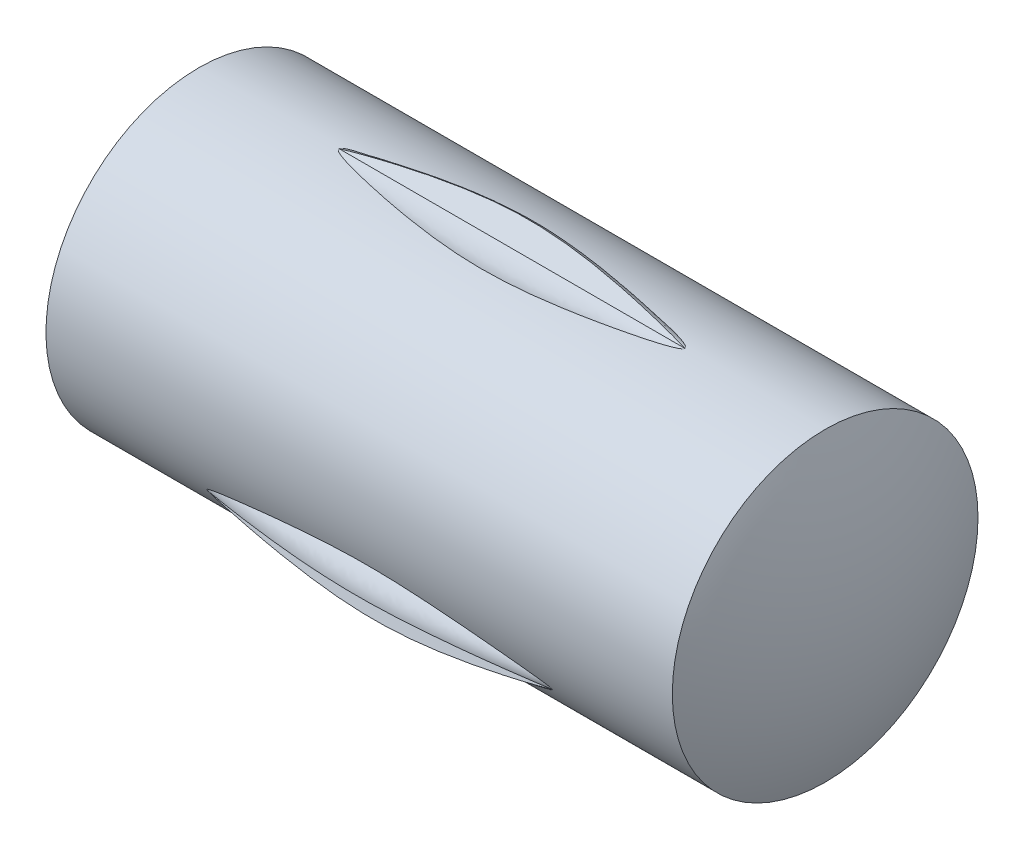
ISO-10303-21;
HEADER;
FILE_DESCRIPTION(('STEP AP214'),'2;1');
FILE_NAME('part.step','',(''),(''),'','','');
FILE_SCHEMA(('AUTOMOTIVE_DESIGN { 1 0 10303 214 1 1 1 1 }'));
ENDSEC;
DATA;
#1=APPLICATION_CONTEXT('core data for automotive mechanical design processes');
#2=APPLICATION_PROTOCOL_DEFINITION('international standard','automotive_design',2000,#1);
#3=PRODUCT_CONTEXT('',#1,'mechanical');
#4=PRODUCT('Part','Part','',(#3));
#5=PRODUCT_RELATED_PRODUCT_CATEGORY('part','',(#4));
#6=PRODUCT_DEFINITION_FORMATION('','',#4);
#7=PRODUCT_DEFINITION_CONTEXT('part definition',#1,'design');
#8=PRODUCT_DEFINITION('design','',#6,#7);
#9=PRODUCT_DEFINITION_SHAPE('','',#8);
#10=(LENGTH_UNIT() NAMED_UNIT(*) SI_UNIT(.MILLI.,.METRE.));
#11=(NAMED_UNIT(*) PLANE_ANGLE_UNIT() SI_UNIT($,.RADIAN.));
#12=(NAMED_UNIT(*) SI_UNIT($,.STERADIAN.) SOLID_ANGLE_UNIT());
#13=UNCERTAINTY_MEASURE_WITH_UNIT(LENGTH_MEASURE(1.E-05),#10,'distance_accuracy_value','');
#14=(GEOMETRIC_REPRESENTATION_CONTEXT(3) GLOBAL_UNCERTAINTY_ASSIGNED_CONTEXT((#13)) GLOBAL_UNIT_ASSIGNED_CONTEXT((#10,
#11,#12)) REPRESENTATION_CONTEXT('',''));
#15=CARTESIAN_POINT('',(0.,0.,0.));
#16=DIRECTION('',(0.,0.,1.));
#17=DIRECTION('',(1.,0.,0.));
#18=AXIS2_PLACEMENT_3D('',#15,#16,#17);
#19=CARTESIAN_POINT('',(0.8763,-0.388870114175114,0.669991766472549));
#20=CARTESIAN_POINT('',(0.58419979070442,-0.417586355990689,0.716876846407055));
#21=CARTESIAN_POINT('',(-1.46507326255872E-06,-0.475018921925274,0.810647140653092));
#22=CARTESIAN_POINT('',(-0.58420020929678,-0.418041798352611,0.716583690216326));
#23=CARTESIAN_POINT('',(-0.8763,-0.389553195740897,0.669551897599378));
#24=CARTESIAN_POINT('',(0.8763,-0.378911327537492,0.676278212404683));
#25=CARTESIAN_POINT('',(0.58419979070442,-0.395353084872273,0.730681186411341));
#26=CARTESIAN_POINT('',(-1.46507326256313E-06,-0.42823664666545,0.839487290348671));
#27=CARTESIAN_POINT('',(-0.58420020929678,-0.395885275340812,0.730507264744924));
#28=CARTESIAN_POINT('',(-0.8763,-0.379709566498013,0.676017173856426));
#29=CARTESIAN_POINT('',(0.8763,-0.353634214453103,0.679154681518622));
#30=CARTESIAN_POINT('',(0.58419979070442,-0.339517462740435,0.739162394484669));
#31=CARTESIAN_POINT('',(-1.46507326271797E-06,-0.311283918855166,0.859177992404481));
#32=CARTESIAN_POINT('',(-0.58420020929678,-0.34008697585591,0.739292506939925));
#33=CARTESIAN_POINT('',(-0.8763,-0.354488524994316,0.679349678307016));
#34=CARTESIAN_POINT('',(0.876300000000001,-0.321704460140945,0.659556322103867));
#35=CARTESIAN_POINT('',(0.58419979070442,-0.270186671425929,0.690898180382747));
#36=CARTESIAN_POINT('',(-1.46507326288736E-06,-0.167150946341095,0.753581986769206));
#37=CARTESIAN_POINT('',(-0.58420020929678,-0.270523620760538,0.691414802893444));
#38=CARTESIAN_POINT('',(-0.8763,-0.322210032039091,0.660331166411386));
#39=CARTESIAN_POINT('',(0.8763,-0.317825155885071,0.621221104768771));
#40=CARTESIAN_POINT('',(0.584199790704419,-0.257746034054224,0.606871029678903));
#41=CARTESIAN_POINT('',(-1.4650732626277E-06,-0.137587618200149,0.578170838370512));
#42=CARTESIAN_POINT('',(-0.58420020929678,-0.257621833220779,0.607438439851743));
#43=CARTESIAN_POINT('',(-0.8763,-0.317639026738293,0.62207226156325));
#44=CARTESIAN_POINT('',(0.876299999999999,-0.337291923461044,0.588283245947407));
#45=CARTESIAN_POINT('',(0.584199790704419,-0.305914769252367,0.537025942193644));
#46=CARTESIAN_POINT('',(-1.46507326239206E-06,-0.243160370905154,0.43451118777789));
#47=CARTESIAN_POINT('',(-0.58420020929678,-0.30539193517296,0.537362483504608));
#48=CARTESIAN_POINT('',(-0.8763,-0.33650776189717,0.588788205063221));
#49=CARTESIAN_POINT('',(0.8763,-0.375400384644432,0.584876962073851));
#50=CARTESIAN_POINT('',(0.584199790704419,-0.389891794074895,0.524829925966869));
#51=CARTESIAN_POINT('',(-1.46507326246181E-06,-0.418874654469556,0.404735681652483));
#52=CARTESIAN_POINT('',(-0.58420020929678,-0.389323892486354,0.524707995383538));
#53=CARTESIAN_POINT('',(-0.8763,-0.374548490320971,0.58469423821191));
#54=CARTESIAN_POINT('',(0.8763,-0.408339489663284,0.604868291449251));
#55=CARTESIAN_POINT('',(0.58419979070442,-0.459675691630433,0.573239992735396));
#56=CARTESIAN_POINT('',(-1.46507326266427E-06,-0.562348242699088,0.509983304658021));
#57=CARTESIAN_POINT('',(-0.58420020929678,-0.459344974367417,0.572719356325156));
#58=CARTESIAN_POINT('',(-0.8763,-0.407843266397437,0.604087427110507));
#59=CARTESIAN_POINT('',(0.8763,-0.41229818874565,0.642123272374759));
#60=CARTESIAN_POINT('',(0.58419979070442,-0.472181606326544,0.65679602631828));
#61=CARTESIAN_POINT('',(-1.46507326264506E-06,-0.59194861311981,0.686141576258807));
#62=CARTESIAN_POINT('',(-0.58420020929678,-0.472299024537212,0.656223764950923));
#63=CARTESIAN_POINT('',(-0.8763,-0.412474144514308,0.6412648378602));
#64=CARTESIAN_POINT('',(0.8763,-0.398828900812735,0.663705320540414));
#65=CARTESIAN_POINT('',(0.58419979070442,-0.439819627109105,0.703072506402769));
#66=CARTESIAN_POINT('',(-1.46507326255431E-06,-0.521801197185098,0.781806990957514));
#67=CARTESIAN_POINT('',(-0.58420020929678,-0.44019832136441,0.702660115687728));
#68=CARTESIAN_POINT('',(-0.8763,-0.399396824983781,0.663086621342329));
#69=CARTESIAN_POINT('',(0.8763,-0.388870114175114,0.669991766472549));
#70=CARTESIAN_POINT('',(0.58419979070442,-0.417586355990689,0.716876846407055));
#71=CARTESIAN_POINT('',(-1.46507326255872E-06,-0.475018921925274,0.810647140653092));
#72=CARTESIAN_POINT('',(-0.58420020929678,-0.418041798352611,0.716583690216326));
#73=CARTESIAN_POINT('',(-0.8763,-0.389553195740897,0.669551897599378));
#74=B_SPLINE_SURFACE_WITH_KNOTS('',3,3,((#19,#20,#21,#22,#23),(#24,#25,#26,#27,#28),(#29,#30,
#31,#32,#33),(#34,#35,#36,#37,#38),(#39,#40,#41,#42,#43),(#44,#45,#46,#47,#48),(#49,#50,#51,#52,
#53),(#54,#55,#56,#57,#58),(#59,#60,#61,#62,#63),(#64,#65,#66,#67,#68),(#69,#70,#71,#72,#73)),
.UNSPECIFIED.,.T.,.F.,.F.,(4,1,1,1,1,1,1,1,4),(4,1,4),(0.,0.125,0.25,0.375,0.5,0.625,0.75,0.875,
1.),(0.,0.499999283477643,1.),.UNSPECIFIED.);
#75=CARTESIAN_POINT('',(0.876270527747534,-0.387605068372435,0.670762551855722));
#76=CARTESIAN_POINT('',(0.876272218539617,-0.386775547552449,0.671241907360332));
#77=CARTESIAN_POINT('',(0.876079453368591,-0.385945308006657,0.671719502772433));
#78=CARTESIAN_POINT('',(0.875304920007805,-0.384097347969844,0.672778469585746));
#79=CARTESIAN_POINT('',(0.874607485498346,-0.383120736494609,0.67333471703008));
#80=CARTESIAN_POINT('',(0.872823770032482,-0.381132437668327,0.674462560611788));
#81=CARTESIAN_POINT('',(0.87168577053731,-0.380159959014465,0.675010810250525));
#82=CARTESIAN_POINT('',(0.869266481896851,-0.378352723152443,0.676025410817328));
#83=CARTESIAN_POINT('',(0.867984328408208,-0.377518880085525,0.676491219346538));
#84=CARTESIAN_POINT('',(0.864119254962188,-0.375208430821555,0.677777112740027));
#85=CARTESIAN_POINT('',(0.861438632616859,-0.373857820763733,0.678522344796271));
#86=CARTESIAN_POINT('',(0.855968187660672,-0.371331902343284,0.679907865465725));
#87=CARTESIAN_POINT('',(0.853178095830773,-0.370157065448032,0.680547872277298));
#88=CARTESIAN_POINT('',(0.844716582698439,-0.36679848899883,0.682367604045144));
#89=CARTESIAN_POINT('',(0.838957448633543,-0.364782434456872,0.683446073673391));
#90=CARTESIAN_POINT('',(0.821671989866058,-0.359104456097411,0.686456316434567));
#91=CARTESIAN_POINT('',(0.810013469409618,-0.355761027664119,0.688191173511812));
#92=CARTESIAN_POINT('',(0.786553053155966,-0.349465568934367,0.691408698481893));
#93=CARTESIAN_POINT('',(0.77475105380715,-0.346513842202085,0.692891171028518));
#94=CARTESIAN_POINT('',(0.751085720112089,-0.340859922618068,0.69568999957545));
#95=CARTESIAN_POINT('',(0.739222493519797,-0.338157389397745,0.697006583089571));
#96=CARTESIAN_POINT('',(0.715452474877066,-0.332920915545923,0.69952278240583));
#97=CARTESIAN_POINT('',(0.703545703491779,-0.330386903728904,0.700722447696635));
#98=CARTESIAN_POINT('',(0.667736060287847,-0.322967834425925,0.704188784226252));
#99=CARTESIAN_POINT('',(0.643780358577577,-0.318274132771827,0.70631868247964));
#100=CARTESIAN_POINT('',(0.595773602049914,-0.309271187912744,0.710306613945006));
#101=CARTESIAN_POINT('',(0.571722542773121,-0.304961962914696,0.712164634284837));
#102=CARTESIAN_POINT('',(0.499430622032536,-0.292577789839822,0.717383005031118));
#103=CARTESIAN_POINT('',(0.45107338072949,-0.28505088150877,0.720385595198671));
#104=CARTESIAN_POINT('',(0.305713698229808,-0.265060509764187,0.728086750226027));
#105=CARTESIAN_POINT('',(0.208225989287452,-0.255145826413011,0.731496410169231));
#106=CARTESIAN_POINT('',(0.0723433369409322,-0.248980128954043,0.733601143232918));
#107=CARTESIAN_POINT('',(0.0341777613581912,-0.248083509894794,0.733903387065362));
#108=CARTESIAN_POINT('',(-0.0421554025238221,-0.248211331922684,0.733860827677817));
#109=CARTESIAN_POINT('',(-0.0803229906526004,-0.249235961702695,0.733515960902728));
#110=CARTESIAN_POINT('',(-0.15664156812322,-0.25293891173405,0.732246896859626));
#111=CARTESIAN_POINT('',(-0.194792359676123,-0.25562064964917,0.731321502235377));
#112=CARTESIAN_POINT('',(-0.270949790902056,-0.262383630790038,0.728922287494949));
#113=CARTESIAN_POINT('',(-0.308956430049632,-0.266464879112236,0.727448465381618));
#114=CARTESIAN_POINT('',(-0.384685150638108,-0.27576940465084,0.723972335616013));
#115=CARTESIAN_POINT('',(-0.422407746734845,-0.280989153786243,0.721971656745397));
#116=CARTESIAN_POINT('',(-0.497676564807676,-0.292391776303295,0.717429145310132));
#117=CARTESIAN_POINT('',(-0.535222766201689,-0.298574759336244,0.71488725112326));
#118=CARTESIAN_POINT('',(-0.610032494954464,-0.311786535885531,0.709226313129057));
#119=CARTESIAN_POINT('',(-0.647296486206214,-0.318813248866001,0.706108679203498));
#120=CARTESIAN_POINT('',(-0.702965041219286,-0.33022467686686,0.700805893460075));
#121=CARTESIAN_POINT('',(-0.72148951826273,-0.334175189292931,0.698933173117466));
#122=CARTESIAN_POINT('',(-0.758407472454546,-0.342507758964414,0.694889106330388));
#123=CARTESIAN_POINT('',(-0.776801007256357,-0.34688961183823,0.692717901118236));
#124=CARTESIAN_POINT('',(-0.804151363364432,-0.354162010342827,0.689011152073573));
#125=CARTESIAN_POINT('',(-0.813231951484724,-0.356703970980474,0.687699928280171));
#126=CARTESIAN_POINT('',(-0.83123554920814,-0.362165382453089,0.684840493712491));
#127=CARTESIAN_POINT('',(-0.840158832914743,-0.365084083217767,0.68329275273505));
#128=CARTESIAN_POINT('',(-0.852165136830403,-0.369774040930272,0.680756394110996));
#129=CARTESIAN_POINT('',(-0.855451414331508,-0.371140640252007,0.680012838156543));
#130=CARTESIAN_POINT('',(-0.861869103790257,-0.374115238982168,0.678381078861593));
#131=CARTESIAN_POINT('',(-0.86500087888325,-0.375722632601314,0.677493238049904));
#132=CARTESIAN_POINT('',(-0.869918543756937,-0.378860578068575,0.675741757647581));
#133=CARTESIAN_POINT('',(-0.871810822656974,-0.380246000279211,0.674964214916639));
#134=CARTESIAN_POINT('',(-0.874140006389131,-0.382683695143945,0.673583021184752));
#135=CARTESIAN_POINT('',(-0.87482545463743,-0.383542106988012,0.673094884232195));
#136=CARTESIAN_POINT('',(-0.875763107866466,-0.385252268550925,0.672117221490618));
#137=CARTESIAN_POINT('',(-0.876070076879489,-0.386078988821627,0.671642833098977));
#138=CARTESIAN_POINT('',(-0.876298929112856,-0.38778260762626,0.67066063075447));
#139=CARTESIAN_POINT('',(-0.876218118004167,-0.388659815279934,0.670152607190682));
#140=CARTESIAN_POINT('',(-0.875672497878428,-0.390412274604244,0.669133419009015));
#141=CARTESIAN_POINT('',(-0.875165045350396,-0.391275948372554,0.668628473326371));
#142=CARTESIAN_POINT('',(-0.87346054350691,-0.393500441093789,0.6673232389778));
#143=CARTESIAN_POINT('',(-0.872035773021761,-0.394712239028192,0.66660635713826));
#144=CARTESIAN_POINT('',(-0.86886629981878,-0.39699702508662,0.66524828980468));
#145=CARTESIAN_POINT('',(-0.867104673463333,-0.39804935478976,0.664618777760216));
#146=CARTESIAN_POINT('',(-0.863471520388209,-0.400005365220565,0.66344335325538));
#147=CARTESIAN_POINT('',(-0.861599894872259,-0.400908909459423,0.662897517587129));
#148=CARTESIAN_POINT('',(-0.855871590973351,-0.40349295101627,0.661330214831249));
#149=CARTESIAN_POINT('',(-0.851931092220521,-0.405029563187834,0.660389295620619));
#150=CARTESIAN_POINT('',(-0.84012810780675,-0.409308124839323,0.657752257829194));
#151=CARTESIAN_POINT('',(-0.832142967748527,-0.411785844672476,0.656201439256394));
#152=CARTESIAN_POINT('',(-0.816044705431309,-0.41642671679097,0.653265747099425));
#153=CARTESIAN_POINT('',(-0.807931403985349,-0.418589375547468,0.651881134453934));
#154=CARTESIAN_POINT('',(-0.79168198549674,-0.422698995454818,0.649223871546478));
#155=CARTESIAN_POINT('',(-0.783546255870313,-0.424647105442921,0.647950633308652));
#156=CARTESIAN_POINT('',(-0.767238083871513,-0.428399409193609,0.645475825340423));
#157=CARTESIAN_POINT('',(-0.759065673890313,-0.430203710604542,0.644274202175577));
#158=CARTESIAN_POINT('',(-0.734527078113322,-0.435451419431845,0.64074957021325));
#159=CARTESIAN_POINT('',(-0.718115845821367,-0.438735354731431,0.63850307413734));
#160=CARTESIAN_POINT('',(-0.685221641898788,-0.445019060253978,0.634139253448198));
#161=CARTESIAN_POINT('',(-0.668738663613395,-0.448018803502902,0.632021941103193));
#162=CARTESIAN_POINT('',(-0.61919452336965,-0.456686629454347,0.625818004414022));
#163=CARTESIAN_POINT('',(-0.586055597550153,-0.462019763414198,0.621881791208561));
#164=CARTESIAN_POINT('',(-0.519560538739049,-0.471959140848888,0.61437213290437));
#165=CARTESIAN_POINT('',(-0.48620410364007,-0.476563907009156,0.610799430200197));
#166=CARTESIAN_POINT('',(-0.419358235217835,-0.485018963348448,0.604107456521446));
#167=CARTESIAN_POINT('',(-0.385868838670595,-0.488869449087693,0.60098806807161));
#168=CARTESIAN_POINT('',(-0.318735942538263,-0.495759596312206,0.595317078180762));
#169=CARTESIAN_POINT('',(-0.285092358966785,-0.498798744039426,0.592765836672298));
#170=CARTESIAN_POINT('',(-0.217684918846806,-0.503971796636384,0.588374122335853));
#171=CARTESIAN_POINT('',(-0.183921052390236,-0.506105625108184,0.586533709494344));
#172=CARTESIAN_POINT('',(-0.11635829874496,-0.509366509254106,0.583704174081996));
#173=CARTESIAN_POINT('',(-0.0825595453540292,-0.51049510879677,0.582713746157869));
#174=CARTESIAN_POINT('',(-0.0149318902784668,-0.511599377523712,0.581744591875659));
#175=CARTESIAN_POINT('',(0.0188970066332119,-0.511575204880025,0.581765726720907));
#176=CARTESIAN_POINT('',(0.098397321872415,-0.510176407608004,0.582993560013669));
#177=CARTESIAN_POINT('',(0.144054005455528,-0.50833033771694,0.584614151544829));
#178=CARTESIAN_POINT('',(0.235202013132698,-0.5028862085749,0.58930299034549));
#179=CARTESIAN_POINT('',(0.280693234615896,-0.499287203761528,0.592372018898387));
#180=CARTESIAN_POINT('',(0.388102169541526,-0.488972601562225,0.600937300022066));
#181=CARTESIAN_POINT('',(0.449918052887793,-0.481597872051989,0.606911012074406));
#182=CARTESIAN_POINT('',(0.553082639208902,-0.46716485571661,0.618038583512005));
#183=CARTESIAN_POINT('',(0.594568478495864,-0.460779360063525,0.622830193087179));
#184=CARTESIAN_POINT('',(0.663645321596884,-0.449021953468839,0.631326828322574));
#185=CARTESIAN_POINT('',(0.691315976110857,-0.444008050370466,0.63487049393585));
#186=CARTESIAN_POINT('',(0.737310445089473,-0.434902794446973,0.641123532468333));
#187=CARTESIAN_POINT('',(0.755696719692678,-0.431055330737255,0.643720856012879));
#188=CARTESIAN_POINT('',(0.786213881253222,-0.424061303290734,0.648338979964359));
#189=CARTESIAN_POINT('',(0.798400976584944,-0.421104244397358,0.650266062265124));
#190=CARTESIAN_POINT('',(0.818594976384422,-0.415715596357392,0.653718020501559));
#191=CARTESIAN_POINT('',(0.826653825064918,-0.41343275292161,0.65516568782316));
#192=CARTESIAN_POINT('',(0.83997942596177,-0.409246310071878,0.657785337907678));
#193=CARTESIAN_POINT('',(0.845294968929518,-0.407463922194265,0.658891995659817));
#194=CARTESIAN_POINT('',(0.854045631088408,-0.404155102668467,0.660924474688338));
#195=CARTESIAN_POINT('',(0.857532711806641,-0.402732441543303,0.661792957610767));
#196=CARTESIAN_POINT('',(0.86389298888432,-0.399767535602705,0.663587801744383));
#197=CARTESIAN_POINT('',(0.866787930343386,-0.398263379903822,0.664492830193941));
#198=CARTESIAN_POINT('',(0.870967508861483,-0.395460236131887,0.666162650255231));
#199=CARTESIAN_POINT('',(0.872408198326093,-0.394352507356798,0.666819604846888));
#200=CARTESIAN_POINT('',(0.874404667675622,-0.392261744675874,0.668050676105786));
#201=CARTESIAN_POINT('',(0.875091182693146,-0.391382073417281,0.668566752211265));
#202=CARTESIAN_POINT('',(0.876005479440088,-0.38952664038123,0.669649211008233));
#203=CARTESIAN_POINT('',(0.876268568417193,-0.388566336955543,0.67020706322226));
#204=CARTESIAN_POINT('',(0.876270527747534,-0.387605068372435,0.670762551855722));
#205=B_SPLINE_CURVE_WITH_KNOTS('',3,(#75,#76,#77,#78,#79,#80,#81,#82,#83,#84,#85,#86,#87,#88,
#89,#90,#91,#92,#93,#94,#95,#96,#97,#98,#99,#100,#101,#102,#103,#104,#105,#106,#107,#108,#109,
#110,#111,#112,#113,#114,#115,#116,#117,#118,#119,#120,#121,#122,#123,#124,#125,#126,#127,#128,
#129,#130,#131,#132,#133,#134,#135,#136,#137,#138,#139,#140,#141,#142,#143,#144,#145,#146,#147,
#148,#149,#150,#151,#152,#153,#154,#155,#156,#157,#158,#159,#160,#161,#162,#163,#164,#165,#166,
#167,#168,#169,#170,#171,#172,#173,#174,#175,#176,#177,#178,#179,#180,#181,#182,#183,#184,#185,
#186,#187,#188,#189,#190,#191,#192,#193,#194,#195,#196,#197,#198,#199,#200,#201,#202,#203,#204),
.UNSPECIFIED.,.T.,.F.,(4,2,2,2,2,2,2,2,2,2,2,2,2,2,2,2,2,2,2,2,2,2,2,2,2,2,2,2,2,2,2,2,2,2,2,2,
2,2,2,2,2,2,2,2,2,2,2,2,2,2,2,2,2,2,2,2,2,2,2,2,2,2,2,2,4),(0.,0.00286481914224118,
0.00676794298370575,0.01152635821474,0.0163150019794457,0.0255706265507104,0.0348506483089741,
0.0534227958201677,0.0901571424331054,0.126919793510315,0.16363146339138,0.200327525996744,
0.273832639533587,0.34734123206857,0.494427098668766,0.787992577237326,0.902479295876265,
1.01697725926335,1.13171215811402,1.24644747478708,1.36083216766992,1.47522989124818,
1.58935110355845,1.64645016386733,1.70352229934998,1.73208256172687,1.76058681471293,
1.77148638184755,1.78235897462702,1.78969435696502,1.79326556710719,1.79621295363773,
1.7991808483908,1.80248641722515,1.80841382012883,1.81484684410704,1.8212857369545,
1.83427007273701,1.85975804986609,1.88528553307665,1.91066889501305,1.93603307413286,
1.98668752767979,2.03734678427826,2.13871915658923,2.24029457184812,2.34184361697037,
2.44345681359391,2.54507858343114,2.64654400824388,2.74799551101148,2.88508804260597,
3.02225460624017,3.20978704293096,3.33651070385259,3.42153016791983,3.47841084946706,
3.51646492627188,3.54195776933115,3.55908881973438,3.57067718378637,3.58079488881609,
3.58654933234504,3.59019250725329,3.5935123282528),.UNSPECIFIED.);
#206=CARTESIAN_POINT('',(-0.876226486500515,-0.387350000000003,0.670909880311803));
#207=VERTEX_POINT('',#206);
#208=CARTESIAN_POINT('',(0.876264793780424,-0.387350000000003,0.670909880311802));
#209=VERTEX_POINT('',#208);
#210=EDGE_CURVE('E205',#207,#209,#205,.T.);
#211=CARTESIAN_POINT('',(0.876264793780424,-0.387350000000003,0.670909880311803));
#212=CARTESIAN_POINT('',(0.863919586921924,-0.390506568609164,0.671755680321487));
#213=CARTESIAN_POINT('',(0.851524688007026,-0.393467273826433,0.672548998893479));
#214=CARTESIAN_POINT('',(0.82667536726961,-0.399130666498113,0.674066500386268));
#215=CARTESIAN_POINT('',(0.814220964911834,-0.401833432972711,0.67479070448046));
#216=CARTESIAN_POINT('',(0.776823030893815,-0.409756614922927,0.676913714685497));
#217=CARTESIAN_POINT('',(0.751838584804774,-0.41479335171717,0.678263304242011));
#218=CARTESIAN_POINT('',(0.701804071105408,-0.424554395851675,0.680878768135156));
#219=CARTESIAN_POINT('',(0.676754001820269,-0.429278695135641,0.682144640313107));
#220=CARTESIAN_POINT('',(0.601472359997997,-0.443021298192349,0.685826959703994));
#221=CARTESIAN_POINT('',(0.551154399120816,-0.451599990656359,0.688125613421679));
#222=CARTESIAN_POINT('',(0.418852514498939,-0.472151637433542,0.693632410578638));
#223=CARTESIAN_POINT('',(0.33665729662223,-0.482912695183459,0.696515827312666));
#224=CARTESIAN_POINT('',(0.171725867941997,-0.49824678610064,0.700624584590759));
#225=CARTESIAN_POINT('',(0.0889910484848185,-0.502832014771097,0.701853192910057));
#226=CARTESIAN_POINT('',(-0.0674936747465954,-0.503216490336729,0.701956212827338));
#227=CARTESIAN_POINT('',(-0.14124016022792,-0.499918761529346,0.701072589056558));
#228=CARTESIAN_POINT('',(-0.2515526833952,-0.491037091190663,0.698692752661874));
#229=CARTESIAN_POINT('',(-0.288319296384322,-0.487413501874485,0.6977218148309));
#230=CARTESIAN_POINT('',(-0.361722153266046,-0.479073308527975,0.695487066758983));
#231=CARTESIAN_POINT('',(-0.398358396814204,-0.474356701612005,0.694223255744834));
#232=CARTESIAN_POINT('',(-0.472080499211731,-0.463946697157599,0.691433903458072));
#233=CARTESIAN_POINT('',(-0.509164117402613,-0.458238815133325,0.689904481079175));
#234=CARTESIAN_POINT('',(-0.583200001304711,-0.446084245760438,0.686647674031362));
#235=CARTESIAN_POINT('',(-0.620152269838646,-0.439637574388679,0.684920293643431));
#236=CARTESIAN_POINT('',(-0.675399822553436,-0.429507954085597,0.682206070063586));
#237=CARTESIAN_POINT('',(-0.693742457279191,-0.426063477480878,0.681283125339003));
#238=CARTESIAN_POINT('',(-0.730392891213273,-0.419009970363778,0.679393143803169));
#239=CARTESIAN_POINT('',(-0.748700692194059,-0.415400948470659,0.678426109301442));
#240=CARTESIAN_POINT('',(-0.785272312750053,-0.407979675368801,0.676437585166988));
#241=CARTESIAN_POINT('',(-0.803536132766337,-0.404167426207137,0.675416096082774));
#242=CARTESIAN_POINT('',(-0.830870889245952,-0.3981794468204,0.673811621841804));
#243=CARTESIAN_POINT('',(-0.839972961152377,-0.396138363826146,0.673264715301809));
#244=CARTESIAN_POINT('',(-0.858136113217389,-0.391888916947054,0.672126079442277));
#245=CARTESIAN_POINT('',(-0.867197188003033,-0.389680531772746,0.671534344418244));
#246=CARTESIAN_POINT('',(-0.876226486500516,-0.387350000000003,0.670909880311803));
#247=B_SPLINE_CURVE_WITH_KNOTS('',3,(#211,#212,#213,#214,#215,#216,#217,#218,#219,#220,#221,
#222,#223,#224,#225,#226,#227,#228,#229,#230,#231,#232,#233,#234,#235,#236,#237,#238,#239,#240,
#241,#242,#243,#244,#245,#246),.UNSPECIFIED.,.F.,.F.,(4,2,2,2,2,2,2,2,2,2,2,2,2,2,2,2,2,4),(0.,
0.0383040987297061,0.0765964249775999,0.15316199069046,0.22972952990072,0.383002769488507,
0.631699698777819,0.879904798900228,1.1010609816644,1.21192391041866,1.3227871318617,
1.43543266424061,1.54807576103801,1.6041333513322,1.66018800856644,1.71624210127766,
1.74427315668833,1.77230778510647),.UNSPECIFIED.);
#248=EDGE_CURVE('E12',#209,#207,#247,.T.);
#249=CARTESIAN_POINT('',(0.8763,-0.321716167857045,0.622120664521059));
#250=CARTESIAN_POINT('',(0.584199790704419,-0.267847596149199,0.609234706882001));
#251=CARTESIAN_POINT('',(-1.4650732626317E-06,-0.160110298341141,0.583462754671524));
#252=CARTESIAN_POINT('',(-0.58420020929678,-0.267733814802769,0.609755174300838));
#253=CARTESIAN_POINT('',(-0.8763,-0.321545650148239,0.622901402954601));
#254=CARTESIAN_POINT('',(0.8763,-0.324314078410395,0.610241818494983));
#255=CARTESIAN_POINT('',(0.584199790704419,-0.273802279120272,0.583589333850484));
#256=CARTESIAN_POINT('',(-1.46507326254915E-06,-0.172778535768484,0.530284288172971));
#257=CARTESIAN_POINT('',(-0.58420020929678,-0.273545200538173,0.584079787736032));
#258=CARTESIAN_POINT('',(-0.8763,-0.323928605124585,0.61097757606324));
#259=CARTESIAN_POINT('',(0.876299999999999,-0.337291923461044,0.588283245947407));
#260=CARTESIAN_POINT('',(0.584199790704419,-0.305914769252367,0.537025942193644));
#261=CARTESIAN_POINT('',(-1.46507326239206E-06,-0.243160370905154,0.43451118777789));
#262=CARTESIAN_POINT('',(-0.58420020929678,-0.30539193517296,0.537362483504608));
#263=CARTESIAN_POINT('',(-0.8763,-0.33650776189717,0.588788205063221));
#264=CARTESIAN_POINT('',(0.8763,-0.375400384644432,0.584876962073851));
#265=CARTESIAN_POINT('',(0.584199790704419,-0.389891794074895,0.524829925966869));
#266=CARTESIAN_POINT('',(-1.46507326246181E-06,-0.418874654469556,0.404735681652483));
#267=CARTESIAN_POINT('',(-0.58420020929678,-0.389323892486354,0.524707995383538));
#268=CARTESIAN_POINT('',(-0.8763,-0.374548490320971,0.58469423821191));
#269=CARTESIAN_POINT('',(0.8763,-0.408339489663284,0.604868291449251));
#270=CARTESIAN_POINT('',(0.58419979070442,-0.459675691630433,0.573239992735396));
#271=CARTESIAN_POINT('',(-1.46507326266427E-06,-0.562348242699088,0.509983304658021));
#272=CARTESIAN_POINT('',(-0.58420020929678,-0.459344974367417,0.572719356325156));
#273=CARTESIAN_POINT('',(-0.8763,-0.407843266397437,0.604087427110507));
#274=CARTESIAN_POINT('',(0.8763,-0.41229818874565,0.642123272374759));
#275=CARTESIAN_POINT('',(0.58419979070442,-0.472181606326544,0.65679602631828));
#276=CARTESIAN_POINT('',(-1.46507326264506E-06,-0.59194861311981,0.686141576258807));
#277=CARTESIAN_POINT('',(-0.58420020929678,-0.472299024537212,0.656223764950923));
#278=CARTESIAN_POINT('',(-0.8763,-0.412474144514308,0.6412648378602));
#279=CARTESIAN_POINT('',(0.8763,-0.398828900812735,0.663705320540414));
#280=CARTESIAN_POINT('',(0.58419979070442,-0.439819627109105,0.703072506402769));
#281=CARTESIAN_POINT('',(-1.46507326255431E-06,-0.521801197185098,0.781806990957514));
#282=CARTESIAN_POINT('',(-0.58420020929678,-0.44019832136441,0.702660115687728));
#283=CARTESIAN_POINT('',(-0.8763,-0.399396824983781,0.663086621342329));
#284=CARTESIAN_POINT('',(0.8763,-0.378911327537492,0.676278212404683));
#285=CARTESIAN_POINT('',(0.58419979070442,-0.395353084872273,0.730681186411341));
#286=CARTESIAN_POINT('',(-1.46507326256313E-06,-0.42823664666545,0.839487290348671));
#287=CARTESIAN_POINT('',(-0.58420020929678,-0.395885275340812,0.730507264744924));
#288=CARTESIAN_POINT('',(-0.8763,-0.379709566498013,0.676017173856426));
#289=CARTESIAN_POINT('',(0.8763,-0.353634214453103,0.679154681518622));
#290=CARTESIAN_POINT('',(0.58419979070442,-0.339517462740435,0.739162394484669));
#291=CARTESIAN_POINT('',(-1.46507326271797E-06,-0.311283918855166,0.859177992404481));
#292=CARTESIAN_POINT('',(-0.58420020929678,-0.34008697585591,0.739292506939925));
#293=CARTESIAN_POINT('',(-0.8763,-0.354488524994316,0.679349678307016));
#294=CARTESIAN_POINT('',(0.876300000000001,-0.321704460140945,0.659556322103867));
#295=CARTESIAN_POINT('',(0.58419979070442,-0.270186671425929,0.690898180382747));
#296=CARTESIAN_POINT('',(-1.46507326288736E-06,-0.167150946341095,0.753581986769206));
#297=CARTESIAN_POINT('',(-0.58420020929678,-0.270523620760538,0.691414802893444));
#298=CARTESIAN_POINT('',(-0.8763,-0.322210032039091,0.660331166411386));
#299=CARTESIAN_POINT('',(0.8763,-0.319118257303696,0.633999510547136));
#300=CARTESIAN_POINT('',(0.58419979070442,-0.261892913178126,0.634880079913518));
#301=CARTESIAN_POINT('',(-1.46507326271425E-06,-0.147442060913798,0.636641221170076));
#302=CARTESIAN_POINT('',(-0.58420020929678,-0.261922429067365,0.635430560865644));
#303=CARTESIAN_POINT('',(-0.8763,-0.319162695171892,0.634825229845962));
#304=CARTESIAN_POINT('',(0.8763,-0.321716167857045,0.622120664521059));
#305=CARTESIAN_POINT('',(0.584199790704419,-0.267847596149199,0.609234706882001));
#306=CARTESIAN_POINT('',(-1.4650732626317E-06,-0.160110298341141,0.583462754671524));
#307=CARTESIAN_POINT('',(-0.58420020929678,-0.267733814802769,0.609755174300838));
#308=CARTESIAN_POINT('',(-0.8763,-0.321545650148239,0.622901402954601));
#309=B_SPLINE_SURFACE_WITH_KNOTS('',3,3,((#249,#250,#251,#252,#253),(#254,#255,#256,#257,#258),
(#259,#260,#261,#262,#263),(#264,#265,#266,#267,#268),(#269,#270,#271,#272,#273),(#274,#275,
#276,#277,#278),(#279,#280,#281,#282,#283),(#284,#285,#286,#287,#288),(#289,#290,#291,#292,
#293),(#294,#295,#296,#297,#298),(#299,#300,#301,#302,#303),(#304,#305,#306,#307,#308)),
.UNSPECIFIED.,.T.,.F.,.F.,(4,1,1,1,1,2,1,1,4),(4,1,4),(0.375,0.5,0.625,0.75,0.875,1.,1.125,1.25,
1.375),(0.,0.499999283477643,1.),.UNSPECIFIED.);
#310=ORIENTED_EDGE('',*,*,#210,.T.);
#311=ORIENTED_EDGE('',*,*,#248,.T.);
#312=EDGE_LOOP('',(#310,#311));
#313=FACE_BOUND('',#312,.T.);
#314=ADVANCED_FACE('F75',(#313),#309,.T.);
#315=EDGE_CURVE('E135',#209,#207,#205,.T.);
#316=CARTESIAN_POINT('',(-0.876226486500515,-0.387350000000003,0.670909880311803));
#317=CARTESIAN_POINT('',(-0.86387002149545,-0.386517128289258,0.674018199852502));
#318=CARTESIAN_POINT('',(-0.851469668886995,-0.385730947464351,0.676952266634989));
#319=CARTESIAN_POINT('',(-0.826615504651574,-0.384221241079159,0.682586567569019));
#320=CARTESIAN_POINT('',(-0.81416170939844,-0.383497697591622,0.685286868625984));
#321=CARTESIAN_POINT('',(-0.776764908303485,-0.381374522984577,0.693210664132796));
#322=CARTESIAN_POINT('',(-0.751782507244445,-0.380022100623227,0.698257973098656));
#323=CARTESIAN_POINT('',(-0.701752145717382,-0.377400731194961,0.708041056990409));
#324=CARTESIAN_POINT('',(-0.676704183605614,-0.37613178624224,0.712776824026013));
#325=CARTESIAN_POINT('',(-0.601429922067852,-0.372441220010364,0.726550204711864));
#326=CARTESIAN_POINT('',(-0.551116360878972,-0.370138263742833,0.735144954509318));
#327=CARTESIAN_POINT('',(-0.418937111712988,-0.364627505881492,0.75571138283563));
#328=CARTESIAN_POINT('',(-0.336859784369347,-0.361744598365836,0.766470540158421));
#329=CARTESIAN_POINT('',(-0.172161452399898,-0.357632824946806,0.781815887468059));
#330=CARTESIAN_POINT('',(-0.0895418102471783,-0.356400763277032,0.786414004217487));
#331=CARTESIAN_POINT('',(0.0668870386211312,-0.356286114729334,0.786841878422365));
#332=CARTESIAN_POINT('',(0.140692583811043,-0.357166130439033,0.783557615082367));
#333=CARTESIAN_POINT('',(0.25109208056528,-0.359544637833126,0.774680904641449));
#334=CARTESIAN_POINT('',(0.287887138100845,-0.360515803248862,0.771056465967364));
#335=CARTESIAN_POINT('',(0.361346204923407,-0.362752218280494,0.762710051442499));
#336=CARTESIAN_POINT('',(0.398010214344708,-0.364017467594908,0.757988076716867));
#337=CARTESIAN_POINT('',(0.471788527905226,-0.366811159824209,0.747561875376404));
#338=CARTESIAN_POINT('',(0.50890057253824,-0.368343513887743,0.741843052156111));
#339=CARTESIAN_POINT('',(0.582992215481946,-0.37160791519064,0.729660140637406));
#340=CARTESIAN_POINT('',(0.619971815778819,-0.373339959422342,0.723196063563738));
#341=CARTESIAN_POINT('',(0.675259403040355,-0.376062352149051,0.713035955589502));
#342=CARTESIAN_POINT('',(0.693615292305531,-0.376988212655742,0.709580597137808));
#343=CARTESIAN_POINT('',(0.730292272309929,-0.378884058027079,0.702505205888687));
#344=CARTESIAN_POINT('',(0.748613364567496,-0.379854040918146,0.698885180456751));
#345=CARTESIAN_POINT('',(0.785211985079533,-0.381847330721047,0.691446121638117));
#346=CARTESIAN_POINT('',(0.803489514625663,-0.382870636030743,0.687627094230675));
#347=CARTESIAN_POINT('',(0.83084874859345,-0.384473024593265,0.681646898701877));
#348=CARTESIAN_POINT('',(0.839959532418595,-0.385018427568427,0.67961142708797));
#349=CARTESIAN_POINT('',(0.858144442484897,-0.386149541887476,0.675390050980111));
#350=CARTESIAN_POINT('',(0.867218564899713,-0.38673525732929,0.673204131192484));
#351=CARTESIAN_POINT('',(0.876264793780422,-0.387350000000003,0.670909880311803));
#352=B_SPLINE_CURVE_WITH_KNOTS('',3,(#316,#317,#318,#319,#320,#321,#322,#323,#324,#325,#326,
#327,#328,#329,#330,#331,#332,#333,#334,#335,#336,#337,#338,#339,#340,#341,#342,#343,#344,#345,
#346,#347,#348,#349,#350,#351),.UNSPECIFIED.,.F.,.F.,(4,2,2,2,2,2,2,2,2,2,2,2,2,2,2,2,2,4),(0.,
0.0383002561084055,0.0765895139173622,0.153155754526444,0.229723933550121,0.38299254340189,
0.631338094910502,0.879202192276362,1.10053182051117,1.21147979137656,1.3224276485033,
1.43516261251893,1.54789587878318,1.60399895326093,1.66009952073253,1.71619840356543,
1.74425123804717,1.77230692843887),.UNSPECIFIED.);
#353=EDGE_CURVE('E89',#207,#209,#352,.T.);
#354=ORIENTED_EDGE('',*,*,#315,.T.);
#355=ORIENTED_EDGE('',*,*,#353,.T.);
#356=EDGE_LOOP('',(#354,#355));
#357=FACE_BOUND('',#356,.T.);
#358=ADVANCED_FACE('F160',(#357),#74,.T.);
#359=CARTESIAN_POINT('',(0.8763,-0.385794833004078,-0.671767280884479));
#360=CARTESIAN_POINT('',(0.58419979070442,-0.412040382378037,-0.720078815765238));
#361=CARTESIAN_POINT('',(-1.46507326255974E-06,-0.464531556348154,-0.816702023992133));
#362=CARTESIAN_POINT('',(-0.58420020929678,-0.411558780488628,-0.720326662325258));
#363=CARTESIAN_POINT('',(-0.8763,-0.385072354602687,-0.672138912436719));
#364=CARTESIAN_POINT('',(0.8763,-0.396218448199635,-0.666285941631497));
#365=CARTESIAN_POINT('',(0.58419979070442,-0.435111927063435,-0.707726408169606));
#366=CARTESIAN_POINT('',(-1.46507326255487E-06,-0.512898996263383,-0.790607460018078));
#367=CARTESIAN_POINT('',(-0.58420020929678,-0.434695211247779,-0.708100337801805));
#368=CARTESIAN_POINT('',(-0.8763,-0.395593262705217,-0.666846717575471));
#369=CARTESIAN_POINT('',(0.8763,-0.411348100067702,-0.645833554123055));
#370=CARTESIAN_POINT('',(0.58419979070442,-0.470374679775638,-0.66361194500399));
#371=CARTESIAN_POINT('',(-1.46507326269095E-06,-0.588428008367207,-0.699168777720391));
#372=CARTESIAN_POINT('',(-0.58420020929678,-0.4702026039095,-0.664170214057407));
#373=CARTESIAN_POINT('',(-0.8763,-0.411089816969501,-0.646670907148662));
#374=CARTESIAN_POINT('',(0.876300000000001,-0.410340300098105,-0.608382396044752));
#375=CARTESIAN_POINT('',(0.58419979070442,-0.463242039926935,-0.579437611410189));
#376=CARTESIAN_POINT('',(-1.46507326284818E-06,-0.569045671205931,-0.521547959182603));
#377=CARTESIAN_POINT('',(-0.58420020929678,-0.463520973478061,-0.579987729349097));
#378=CARTESIAN_POINT('',(-0.8763,-0.410758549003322,-0.609207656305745));
#379=CARTESIAN_POINT('',(0.8763,-0.379080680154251,-0.585855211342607));
#380=CARTESIAN_POINT('',(0.584199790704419,-0.396692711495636,-0.526650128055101));
#381=CARTESIAN_POINT('',(-1.465073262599E-06,-0.431916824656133,-0.408239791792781));
#382=CARTESIAN_POINT('',(-0.58420020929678,-0.397246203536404,-0.526826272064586));
#383=CARTESIAN_POINT('',(-0.8763,-0.379910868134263,-0.586119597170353));
#384=CARTESIAN_POINT('',(0.876299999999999,-0.340822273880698,-0.586244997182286));
#385=CARTESIAN_POINT('',(0.584199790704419,-0.312120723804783,-0.533442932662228));
#386=CARTESIAN_POINT('',(-1.46507326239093E-06,-0.254717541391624,-0.427838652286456));
#387=CARTESIAN_POINT('',(-0.58420020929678,-0.312673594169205,-0.533158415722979));
#388=CARTESIAN_POINT('',(-0.8763,-0.341651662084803,-0.585818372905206));
#389=CARTESIAN_POINT('',(0.8763,-0.318818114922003,-0.617544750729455));
#390=CARTESIAN_POINT('',(0.584199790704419,-0.259570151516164,-0.600071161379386));
#391=CARTESIAN_POINT('',(-1.46507326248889E-06,-0.141074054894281,-0.565123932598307));
#392=CARTESIAN_POINT('',(-0.58420020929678,-0.259748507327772,-0.599518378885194));
#393=CARTESIAN_POINT('',(-0.8763,-0.319085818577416,-0.616715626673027));
#394=CARTESIAN_POINT('',(0.8763,-0.319661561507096,-0.656066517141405));
#395=CARTESIAN_POINT('',(0.58419979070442,-0.26660255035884,-0.684710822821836));
#396=CARTESIAN_POINT('',(-1.46507326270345E-06,-0.160484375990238,-0.741999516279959));
#397=CARTESIAN_POINT('',(-0.58420020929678,-0.266317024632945,-0.684164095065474));
#398=CARTESIAN_POINT('',(-0.8763,-0.319233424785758,-0.655246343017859));
#399=CARTESIAN_POINT('',(0.8763,-0.349945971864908,-0.678122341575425));
#400=CARTESIAN_POINT('',(0.58419979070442,-0.332711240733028,-0.737319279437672));
#401=CARTESIAN_POINT('',(-1.4650732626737E-06,-0.298241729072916,-0.855713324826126));
#402=CARTESIAN_POINT('',(-0.58420020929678,-0.332156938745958,-0.737134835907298));
#403=CARTESIAN_POINT('',(-0.8763,-0.349114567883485,-0.677845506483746));
#404=CARTESIAN_POINT('',(0.8763,-0.375371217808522,-0.677248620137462));
#405=CARTESIAN_POINT('',(0.58419979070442,-0.388968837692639,-0.73243122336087));
#406=CARTESIAN_POINT('',(-1.46507326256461E-06,-0.416164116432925,-0.842796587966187));
#407=CARTESIAN_POINT('',(-0.58420020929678,-0.388422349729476,-0.732552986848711));
#408=CARTESIAN_POINT('',(-0.8763,-0.374551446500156,-0.677431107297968));
#409=CARTESIAN_POINT('',(0.8763,-0.385794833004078,-0.671767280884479));
#410=CARTESIAN_POINT('',(0.58419979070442,-0.412040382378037,-0.720078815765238));
#411=CARTESIAN_POINT('',(-1.46507326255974E-06,-0.464531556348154,-0.816702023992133));
#412=CARTESIAN_POINT('',(-0.58420020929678,-0.411558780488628,-0.720326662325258));
#413=CARTESIAN_POINT('',(-0.8763,-0.385072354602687,-0.672138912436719));
#414=B_SPLINE_SURFACE_WITH_KNOTS('',3,3,((#359,#360,#361,#362,#363),(#364,#365,#366,#367,#368),
(#369,#370,#371,#372,#373),(#374,#375,#376,#377,#378),(#379,#380,#381,#382,#383),(#384,#385,
#386,#387,#388),(#389,#390,#391,#392,#393),(#394,#395,#396,#397,#398),(#399,#400,#401,#402,
#403),(#404,#405,#406,#407,#408),(#409,#410,#411,#412,#413)),.UNSPECIFIED.,.T.,.F.,.F.,(4,1,1,1,
1,1,1,1,4),(4,1,4),(0.,0.125,0.25,0.375,0.5,0.625,0.75,0.875,1.),(0.,0.499999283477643,1.),.UNSPECIFIED.);
#415=CARTESIAN_POINT('',(0.876270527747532,-0.387094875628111,-0.671057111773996));
#416=CARTESIAN_POINT('',(0.876272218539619,-0.38792477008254,-0.670578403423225));
#417=CARTESIAN_POINT('',(0.876079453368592,-0.388753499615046,-0.670098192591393));
#418=CARTESIAN_POINT('',(0.875304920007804,-0.390594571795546,-0.669027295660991));
#419=CARTESIAN_POINT('',(0.874607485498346,-0.391564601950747,-0.668459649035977));
#420=CARTESIAN_POINT('',(0.872823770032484,-0.393535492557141,-0.667301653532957));
#421=CARTESIAN_POINT('',(0.871685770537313,-0.394496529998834,-0.666733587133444));
#422=CARTESIAN_POINT('',(0.869266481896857,-0.39627881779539,-0.665675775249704));
#423=CARTESIAN_POINT('',(0.867984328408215,-0.397099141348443,-0.665186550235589));
#424=CARTESIAN_POINT('',(0.864119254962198,-0.399367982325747,-0.663828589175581));
#425=CARTESIAN_POINT('',(0.861438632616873,-0.400688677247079,-0.663031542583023));
#426=CARTESIAN_POINT('',(0.855968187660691,-0.403151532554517,-0.661536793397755));
#427=CARTESIAN_POINT('',(0.853178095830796,-0.404293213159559,-0.660839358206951));
#428=CARTESIAN_POINT('',(0.84471658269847,-0.407548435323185,-0.658840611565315));
#429=CARTESIAN_POINT('',(0.838957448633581,-0.409490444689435,-0.657633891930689));
#430=CARTESIAN_POINT('',(0.821671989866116,-0.414936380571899,-0.654221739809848));
#431=CARTESIAN_POINT('',(0.810013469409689,-0.418110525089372,-0.652193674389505));
#432=CARTESIAN_POINT('',(0.786553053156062,-0.424044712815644,-0.648350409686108));
#433=CARTESIAN_POINT('',(0.774751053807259,-0.426804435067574,-0.646535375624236));
#434=CARTESIAN_POINT('',(0.751085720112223,-0.432055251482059,-0.643038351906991));
#435=CARTESIAN_POINT('',(0.739222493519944,-0.434546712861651,-0.641356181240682));
#436=CARTESIAN_POINT('',(0.715452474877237,-0.439344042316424,-0.638079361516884));
#437=CARTESIAN_POINT('',(0.703545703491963,-0.441649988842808,-0.636484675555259));
#438=CARTESIAN_POINT('',(0.667736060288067,-0.448361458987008,-0.631792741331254));
#439=CARTESIAN_POINT('',(0.64378035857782,-0.452552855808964,-0.628792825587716));
#440=CARTESIAN_POINT('',(0.595773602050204,-0.46050797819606,-0.622990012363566));
#441=CARTESIAN_POINT('',(0.571722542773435,-0.464271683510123,-0.620187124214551));
#442=CARTESIAN_POINT('',(0.499430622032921,-0.4749830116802,-0.612071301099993));
#443=CARTESIAN_POINT('',(0.451073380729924,-0.481346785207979,-0.607054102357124));
#444=CARTESIAN_POINT('',(0.305713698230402,-0.498011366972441,-0.593592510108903));
#445=CARTESIAN_POINT('',(0.208225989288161,-0.505921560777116,-0.586710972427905));
#446=CARTESIAN_POINT('',(0.0723433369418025,-0.510827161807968,-0.582423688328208));
#447=CARTESIAN_POINT('',(0.0341777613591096,-0.511537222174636,-0.581798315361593));
#448=CARTESIAN_POINT('',(-0.0421554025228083,-0.511436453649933,-0.581887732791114));
#449=CARTESIAN_POINT('',(-0.0803229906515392,-0.510625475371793,-0.582602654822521));
#450=CARTESIAN_POINT('',(-0.156641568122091,-0.507674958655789,-0.585174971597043));
#451=CARTESIAN_POINT('',(-0.194792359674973,-0.505532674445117,-0.587034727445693));
#452=CARTESIAN_POINT('',(-0.270949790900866,-0.500073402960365,-0.591692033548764));
#453=CARTESIAN_POINT('',(-0.308956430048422,-0.496756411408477,-0.594489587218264));
#454=CARTESIAN_POINT('',(-0.384685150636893,-0.489093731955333,-0.600809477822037));
#455=CARTESIAN_POINT('',(-0.422407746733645,-0.484751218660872,-0.604329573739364));
#456=CARTESIAN_POINT('',(-0.497676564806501,-0.475115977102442,-0.611933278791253));
#457=CARTESIAN_POINT('',(-0.535222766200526,-0.469823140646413,-0.616016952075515));
#458=CARTESIAN_POINT('',(-0.61003249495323,-0.458314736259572,-0.624628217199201));
#459=CARTESIAN_POINT('',(-0.6472964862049,-0.452101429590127,-0.629154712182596));
#460=CARTESIAN_POINT('',(-0.702965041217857,-0.441803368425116,-0.636385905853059));
#461=CARTESIAN_POINT('',(-0.721489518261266,-0.438206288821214,-0.638870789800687));
#462=CARTESIAN_POINT('',(-0.758407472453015,-0.430537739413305,-0.644064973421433));
#463=CARTESIAN_POINT('',(-0.776801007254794,-0.426466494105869,-0.646774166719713));
#464=CARTESIAN_POINT('',(-0.804151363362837,-0.419620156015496,-0.651218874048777));
#465=CARTESIAN_POINT('',(-0.813231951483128,-0.41721362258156,-0.652764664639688));
#466=CARTESIAN_POINT('',(-0.83123554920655,-0.412006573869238,-0.656064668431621));
#467=CARTESIAN_POINT('',(-0.840158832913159,-0.409206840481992,-0.657818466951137));
#468=CARTESIAN_POINT('',(-0.852165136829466,-0.404665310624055,-0.66061191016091));
#469=CARTESIAN_POINT('',(-0.855451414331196,-0.40333807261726,-0.661423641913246));
#470=CARTESIAN_POINT('',(-0.861869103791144,-0.400437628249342,-0.663183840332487));
#471=CARTESIAN_POINT('',(-0.865000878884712,-0.398865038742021,-0.664131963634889));
#472=CARTESIAN_POINT('',(-0.869918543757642,-0.395779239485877,-0.665973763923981));
#473=CARTESIAN_POINT('',(-0.871810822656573,-0.394413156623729,-0.666784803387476));
#474=CARTESIAN_POINT('',(-0.874140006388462,-0.391998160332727,-0.668205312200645));
#475=CARTESIAN_POINT('',(-0.874825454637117,-0.391146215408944,-0.66870465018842));
#476=CARTESIAN_POINT('',(-0.875763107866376,-0.389444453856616,-0.669696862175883));
#477=CARTESIAN_POINT('',(-0.876070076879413,-0.388620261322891,-0.670175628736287));
#478=CARTESIAN_POINT('',(-0.876298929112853,-0.386917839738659,-0.671159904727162));
#479=CARTESIAN_POINT('',(-0.876218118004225,-0.386039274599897,-0.671665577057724));
#480=CARTESIAN_POINT('',(-0.875672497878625,-0.384280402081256,-0.672673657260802));
#481=CARTESIAN_POINT('',(-0.875165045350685,-0.383411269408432,-0.673169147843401));
#482=CARTESIAN_POINT('',(-0.873460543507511,-0.381168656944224,-0.674442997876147));
#483=CARTESIAN_POINT('',(-0.872035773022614,-0.379941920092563,-0.675134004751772));
#484=CARTESIAN_POINT('',(-0.868866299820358,-0.377623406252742,-0.676433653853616));
#485=CARTESIAN_POINT('',(-0.867104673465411,-0.376552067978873,-0.677030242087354));
#486=CARTESIAN_POINT('',(-0.863471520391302,-0.374556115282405,-0.678136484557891));
#487=CARTESIAN_POINT('',(-0.861599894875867,-0.373631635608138,-0.678646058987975));
#488=CARTESIAN_POINT('',(-0.855871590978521,-0.370982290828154,-0.680100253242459));
#489=CARTESIAN_POINT('',(-0.851931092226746,-0.369399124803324,-0.680960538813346));
#490=CARTESIAN_POINT('',(-0.840128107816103,-0.364976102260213,-0.6833473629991));
#491=CARTESIAN_POINT('',(-0.83214296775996,-0.362394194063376,-0.684717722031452));
#492=CARTESIAN_POINT('',(-0.816044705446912,-0.357531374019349,-0.687268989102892));
#493=CARTESIAN_POINT('',(-0.807931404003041,-0.355250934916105,-0.688449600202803));
#494=CARTESIAN_POINT('',(-0.791681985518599,-0.350894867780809,-0.690680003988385));
#495=CARTESIAN_POINT('',(-0.783546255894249,-0.3488181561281,-0.691730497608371));
#496=CARTESIAN_POINT('',(-0.767238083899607,-0.344798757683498,-0.693742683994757));
#497=CARTESIAN_POINT('',(-0.759065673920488,-0.342855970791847,-0.694704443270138));
#498=CARTESIAN_POINT('',(-0.734527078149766,-0.337179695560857,-0.697486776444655));
#499=CARTESIAN_POINT('',(-0.718115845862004,-0.333592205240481,-0.699207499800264));
#500=CARTESIAN_POINT('',(-0.685221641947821,-0.326671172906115,-0.702467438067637));
#501=CARTESIAN_POINT('',(-0.668738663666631,-0.323337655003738,-0.704006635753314));
#502=CARTESIAN_POINT('',(-0.619194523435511,-0.31363097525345,-0.708411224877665));
#503=CARTESIAN_POINT('',(-0.586055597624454,-0.307555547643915,-0.711061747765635));
#504=CARTESIAN_POINT('',(-0.519560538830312,-0.296082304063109,-0.715914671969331));
#505=CARTESIAN_POINT('',(-0.486204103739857,-0.290685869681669,-0.718116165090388));
#506=CARTESIAN_POINT('',(-0.419358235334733,-0.280662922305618,-0.722092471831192));
#507=CARTESIAN_POINT('',(-0.385868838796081,-0.276036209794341,-0.723867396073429));
#508=CARTESIAN_POINT('',(-0.318735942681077,-0.267679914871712,-0.726998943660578));
#509=CARTESIAN_POINT('',(-0.285092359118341,-0.263950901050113,-0.728355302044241));
#510=CARTESIAN_POINT('',(-0.217684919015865,-0.257561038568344,-0.730639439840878));
#511=CARTESIAN_POINT('',(-0.183921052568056,-0.254900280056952,-0.731567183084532));
#512=CARTESIAN_POINT('',(-0.11635829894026,-0.250819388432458,-0.732976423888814));
#513=CARTESIAN_POINT('',(-0.0825595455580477,-0.249397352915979,-0.733458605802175));
#514=CARTESIAN_POINT('',(-0.0149318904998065,-0.248005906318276,-0.733930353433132));
#515=CARTESIAN_POINT('',(0.0188970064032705,-0.248036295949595,-0.733919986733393));
#516=CARTESIAN_POINT('',(0.0983973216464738,-0.249799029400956,-0.733322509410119));
#517=CARTESIAN_POINT('',(0.144054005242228,-0.252125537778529,-0.732534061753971));
#518=CARTESIAN_POINT('',(0.235202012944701,-0.258908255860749,-0.730163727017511));
#519=CARTESIAN_POINT('',(0.280693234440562,-0.263365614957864,-0.728581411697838));
#520=CARTESIAN_POINT('',(0.388102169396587,-0.275940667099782,-0.723931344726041));
#521=CARTESIAN_POINT('',(0.449918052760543,-0.284801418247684,-0.720531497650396));
#522=CARTESIAN_POINT('',(0.553082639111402,-0.301654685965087,-0.713595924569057));
#523=CARTESIAN_POINT('',(0.594568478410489,-0.308997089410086,-0.71046172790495));
#524=CARTESIAN_POINT('',(0.663645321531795,-0.322234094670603,-0.704527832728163));
#525=CARTESIAN_POINT('',(0.69131597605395,-0.327809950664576,-0.701957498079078));
#526=CARTESIAN_POINT('',(0.737310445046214,-0.337777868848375,-0.697198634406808));
#527=CARTESIAN_POINT('',(0.755696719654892,-0.341950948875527,-0.695165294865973));
#528=CARTESIAN_POINT('',(0.786213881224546,-0.349447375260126,-0.691417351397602));
#529=CARTESIAN_POINT('',(0.798400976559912,-0.352594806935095,-0.689820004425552));
#530=CARTESIAN_POINT('',(0.818594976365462,-0.358278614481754,-0.686879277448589));
#531=CARTESIAN_POINT('',(0.826653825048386,-0.360673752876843,-0.685626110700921));
#532=CARTESIAN_POINT('',(0.839979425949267,-0.365035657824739,-0.683310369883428));
#533=CARTESIAN_POINT('',(0.84529496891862,-0.366885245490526,-0.682320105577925));
#534=CARTESIAN_POINT('',(0.854045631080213,-0.370299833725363,-0.680470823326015));
#535=CARTESIAN_POINT('',(0.857532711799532,-0.371763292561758,-0.679673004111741));
#536=CARTESIAN_POINT('',(0.863892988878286,-0.374800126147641,-0.678002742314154));
#537=CARTESIAN_POINT('',(0.866787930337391,-0.376335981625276,-0.677152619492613));
#538=CARTESIAN_POINT('',(0.870967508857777,-0.379183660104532,-0.675559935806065));
#539=CARTESIAN_POINT('',(0.872408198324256,-0.380306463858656,-0.674929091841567));
#540=CARTESIAN_POINT('',(0.874404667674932,-0.38241798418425,-0.673733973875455));
#541=CARTESIAN_POINT('',(0.875091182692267,-0.383304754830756,-0.673230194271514));
#542=CARTESIAN_POINT('',(0.876005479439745,-0.385169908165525,-0.672164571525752));
#543=CARTESIAN_POINT('',(0.876268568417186,-0.38613317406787,-0.67161185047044));
#544=CARTESIAN_POINT('',(0.876270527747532,-0.387094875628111,-0.671057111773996));
#545=B_SPLINE_CURVE_WITH_KNOTS('',3,(#415,#416,#417,#418,#419,#420,#421,#422,#423,#424,#425,
#426,#427,#428,#429,#430,#431,#432,#433,#434,#435,#436,#437,#438,#439,#440,#441,#442,#443,#444,
#445,#446,#447,#448,#449,#450,#451,#452,#453,#454,#455,#456,#457,#458,#459,#460,#461,#462,#463,
#464,#465,#466,#467,#468,#469,#470,#471,#472,#473,#474,#475,#476,#477,#478,#479,#480,#481,#482,
#483,#484,#485,#486,#487,#488,#489,#490,#491,#492,#493,#494,#495,#496,#497,#498,#499,#500,#501,
#502,#503,#504,#505,#506,#507,#508,#509,#510,#511,#512,#513,#514,#515,#516,#517,#518,#519,#520,
#521,#522,#523,#524,#525,#526,#527,#528,#529,#530,#531,#532,#533,#534,#535,#536,#537,#538,#539,
#540,#541,#542,#543,#544),.UNSPECIFIED.,.T.,.F.,(4,2,2,2,2,2,2,2,2,2,2,2,2,2,2,2,2,2,2,2,2,2,2,
2,2,2,2,2,2,2,2,2,2,2,2,2,2,2,2,2,2,2,2,2,2,2,2,2,2,2,2,2,2,2,2,2,2,2,2,2,2,2,2,2,4),(0.,
0.00286481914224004,0.00676794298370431,0.0115263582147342,0.0163150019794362,
0.0255706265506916,0.0348506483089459,0.0534227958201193,0.0901571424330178,0.126919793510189,
0.163631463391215,0.200327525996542,0.273832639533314,0.347341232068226,0.494427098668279,
0.787992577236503,0.902479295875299,1.01697725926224,1.13171215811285,1.24644747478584,
1.36083216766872,1.47522989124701,1.58935110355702,1.64645016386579,1.70352229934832,
1.73208256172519,1.76058681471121,1.7714863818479,1.78235897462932,1.78969435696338,
1.793265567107,1.79621295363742,1.79918084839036,1.80248641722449,1.8084138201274,
1.814846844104,1.82128573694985,1.83427007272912,1.85975804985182,1.88528553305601,
1.91066889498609,1.93603307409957,1.98668752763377,2.03734678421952,2.13871915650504,
2.2402945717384,2.34184361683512,2.44345681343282,2.54507858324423,2.6465440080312,
2.74799551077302,2.88508804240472,3.0222546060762,3.20978704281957,3.33651070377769,
3.42153016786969,3.47841084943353,3.51646492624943,3.54195776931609,3.55908881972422,
3.57067718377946,3.58079488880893,3.58654933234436,3.59019250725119,3.59351232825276),.UNSPECIFIED.);
#546=CARTESIAN_POINT('',(-0.876226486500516,-0.387349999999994,-0.670909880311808));
#547=VERTEX_POINT('',#546);
#548=CARTESIAN_POINT('',(0.876264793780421,-0.387349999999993,-0.670909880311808));
#549=VERTEX_POINT('',#548);
#550=EDGE_CURVE('E129',#547,#549,#545,.T.);
#551=CARTESIAN_POINT('',(0.876264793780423,-0.387349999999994,-0.670909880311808));
#552=CARTESIAN_POINT('',(0.863919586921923,-0.386504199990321,-0.674066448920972));
#553=CARTESIAN_POINT('',(0.851524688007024,-0.385710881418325,-0.67702715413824));
#554=CARTESIAN_POINT('',(0.826675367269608,-0.384193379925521,-0.682690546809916));
#555=CARTESIAN_POINT('',(0.814220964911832,-0.383469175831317,-0.685393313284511));
#556=CARTESIAN_POINT('',(0.776823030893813,-0.381346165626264,-0.693316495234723));
#557=CARTESIAN_POINT('',(0.751838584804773,-0.379996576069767,-0.698353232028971));
#558=CARTESIAN_POINT('',(0.701804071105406,-0.377381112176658,-0.708114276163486));
#559=CARTESIAN_POINT('',(0.676754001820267,-0.376115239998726,-0.712838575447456));
#560=CARTESIAN_POINT('',(0.601472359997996,-0.372432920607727,-0.726581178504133));
#561=CARTESIAN_POINT('',(0.551154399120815,-0.370134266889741,-0.735159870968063));
#562=CARTESIAN_POINT('',(0.418852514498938,-0.364627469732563,-0.755711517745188));
#563=CARTESIAN_POINT('',(0.33665729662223,-0.361744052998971,-0.766472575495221));
#564=CARTESIAN_POINT('',(0.171725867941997,-0.357635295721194,-0.781806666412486));
#565=CARTESIAN_POINT('',(0.0889910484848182,-0.356406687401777,-0.786391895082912));
#566=CARTESIAN_POINT('',(-0.0674936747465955,-0.356303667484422,-0.786776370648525));
#567=CARTESIAN_POINT('',(-0.14124016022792,-0.357187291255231,-0.783478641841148));
#568=CARTESIAN_POINT('',(-0.2515526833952,-0.359567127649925,-0.774596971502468));
#569=CARTESIAN_POINT('',(-0.288319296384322,-0.360538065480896,-0.77097338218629));
#570=CARTESIAN_POINT('',(-0.361722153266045,-0.362772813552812,-0.76263318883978));
#571=CARTESIAN_POINT('',(-0.398358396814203,-0.364036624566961,-0.75791658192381));
#572=CARTESIAN_POINT('',(-0.47208049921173,-0.366825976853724,-0.747506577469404));
#573=CARTESIAN_POINT('',(-0.509164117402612,-0.368355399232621,-0.741798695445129));
#574=CARTESIAN_POINT('',(-0.583200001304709,-0.371612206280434,-0.729644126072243));
#575=CARTESIAN_POINT('',(-0.620152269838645,-0.373339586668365,-0.723197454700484));
#576=CARTESIAN_POINT('',(-0.675399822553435,-0.37605381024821,-0.713067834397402));
#577=CARTESIAN_POINT('',(-0.693742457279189,-0.376976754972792,-0.709623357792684));
#578=CARTESIAN_POINT('',(-0.730392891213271,-0.378866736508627,-0.702569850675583));
#579=CARTESIAN_POINT('',(-0.748700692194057,-0.379833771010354,-0.698960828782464));
#580=CARTESIAN_POINT('',(-0.785272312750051,-0.381822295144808,-0.691539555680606));
#581=CARTESIAN_POINT('',(-0.803536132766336,-0.382843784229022,-0.687727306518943));
#582=CARTESIAN_POINT('',(-0.83087088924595,-0.384448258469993,-0.681739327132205));
#583=CARTESIAN_POINT('',(-0.839972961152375,-0.384995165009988,-0.679698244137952));
#584=CARTESIAN_POINT('',(-0.858136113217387,-0.386133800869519,-0.675448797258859));
#585=CARTESIAN_POINT('',(-0.867197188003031,-0.386725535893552,-0.673240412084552));
#586=CARTESIAN_POINT('',(-0.876226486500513,-0.387349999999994,-0.670909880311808));
#587=B_SPLINE_CURVE_WITH_KNOTS('',3,(#551,#552,#553,#554,#555,#556,#557,#558,#559,#560,#561,
#562,#563,#564,#565,#566,#567,#568,#569,#570,#571,#572,#573,#574,#575,#576,#577,#578,#579,#580,
#581,#582,#583,#584,#585,#586),.UNSPECIFIED.,.F.,.F.,(4,2,2,2,2,2,2,2,2,2,2,2,2,2,2,2,2,4),(0.,
0.0383040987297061,0.0765964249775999,0.15316199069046,0.22972952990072,0.383002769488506,
0.631699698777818,0.879904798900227,1.1010609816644,1.21192391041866,1.32278713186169,
1.43543266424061,1.54807576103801,1.60413335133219,1.66018800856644,1.71624210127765,
1.74427315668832,1.77230778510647),.UNSPECIFIED.);
#588=EDGE_CURVE('E119',#549,#547,#587,.T.);
#589=CARTESIAN_POINT('',(0.8763,-0.377914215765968,-0.589674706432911));
#590=CARTESIAN_POINT('',(0.584199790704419,-0.393688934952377,-0.536580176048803));
#591=CARTESIAN_POINT('',(-1.46507326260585E-06,-0.425238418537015,-0.430390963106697));
#592=CARTESIAN_POINT('',(-0.58420020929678,-0.394196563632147,-0.536741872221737));
#593=CARTESIAN_POINT('',(-0.8763,-0.37867561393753,-0.589917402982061));
#594=CARTESIAN_POINT('',(0.8763,-0.366327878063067,-0.585985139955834));
#595=CARTESIAN_POINT('',(0.584199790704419,-0.368502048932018,-0.528914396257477));
#596=CARTESIAN_POINT('',(-1.46507326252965E-06,-0.372850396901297,-0.414772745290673));
#597=CARTESIAN_POINT('',(-0.58420020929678,-0.369055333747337,-0.528936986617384));
#598=CARTESIAN_POINT('',(-0.8763,-0.36715779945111,-0.586019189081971));
#599=CARTESIAN_POINT('',(0.876299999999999,-0.340822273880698,-0.586244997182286));
#600=CARTESIAN_POINT('',(0.584199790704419,-0.312120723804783,-0.533442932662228));
#601=CARTESIAN_POINT('',(-1.46507326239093E-06,-0.254717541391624,-0.427838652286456));
#602=CARTESIAN_POINT('',(-0.58420020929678,-0.312673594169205,-0.533158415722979));
#603=CARTESIAN_POINT('',(-0.8763,-0.341651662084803,-0.585818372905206));
#604=CARTESIAN_POINT('',(0.8763,-0.318818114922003,-0.617544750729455));
#605=CARTESIAN_POINT('',(0.584199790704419,-0.259570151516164,-0.600071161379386));
#606=CARTESIAN_POINT('',(-1.46507326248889E-06,-0.141074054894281,-0.565123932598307));
#607=CARTESIAN_POINT('',(-0.58420020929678,-0.259748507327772,-0.599518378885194));
#608=CARTESIAN_POINT('',(-0.8763,-0.319085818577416,-0.616715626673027));
#609=CARTESIAN_POINT('',(0.8763,-0.319661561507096,-0.656066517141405));
#610=CARTESIAN_POINT('',(0.58419979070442,-0.26660255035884,-0.684710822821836));
#611=CARTESIAN_POINT('',(-1.46507326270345E-06,-0.160484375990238,-0.741999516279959));
#612=CARTESIAN_POINT('',(-0.58420020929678,-0.266317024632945,-0.684164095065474));
#613=CARTESIAN_POINT('',(-0.8763,-0.319233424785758,-0.655246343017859));
#614=CARTESIAN_POINT('',(0.8763,-0.349945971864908,-0.678122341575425));
#615=CARTESIAN_POINT('',(0.58419979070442,-0.332711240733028,-0.737319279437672));
#616=CARTESIAN_POINT('',(-1.4650732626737E-06,-0.298241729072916,-0.855713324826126));
#617=CARTESIAN_POINT('',(-0.58420020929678,-0.332156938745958,-0.737134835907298));
#618=CARTESIAN_POINT('',(-0.8763,-0.349114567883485,-0.677845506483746));
#619=CARTESIAN_POINT('',(0.8763,-0.375371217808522,-0.677248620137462));
#620=CARTESIAN_POINT('',(0.58419979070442,-0.388968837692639,-0.73243122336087));
#621=CARTESIAN_POINT('',(-1.46507326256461E-06,-0.416164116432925,-0.842796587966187));
#622=CARTESIAN_POINT('',(-0.58420020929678,-0.388422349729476,-0.732552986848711));
#623=CARTESIAN_POINT('',(-0.8763,-0.374551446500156,-0.677431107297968));
#624=CARTESIAN_POINT('',(0.8763,-0.396218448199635,-0.666285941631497));
#625=CARTESIAN_POINT('',(0.58419979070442,-0.435111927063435,-0.707726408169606));
#626=CARTESIAN_POINT('',(-1.46507326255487E-06,-0.512898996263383,-0.790607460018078));
#627=CARTESIAN_POINT('',(-0.58420020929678,-0.434695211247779,-0.708100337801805));
#628=CARTESIAN_POINT('',(-0.8763,-0.395593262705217,-0.666846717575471));
#629=CARTESIAN_POINT('',(0.8763,-0.411348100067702,-0.645833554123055));
#630=CARTESIAN_POINT('',(0.58419979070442,-0.470374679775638,-0.66361194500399));
#631=CARTESIAN_POINT('',(-1.46507326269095E-06,-0.588428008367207,-0.699168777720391));
#632=CARTESIAN_POINT('',(-0.58420020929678,-0.4702026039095,-0.664170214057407));
#633=CARTESIAN_POINT('',(-0.8763,-0.411089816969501,-0.646670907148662));
#634=CARTESIAN_POINT('',(0.876300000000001,-0.410340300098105,-0.608382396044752));
#635=CARTESIAN_POINT('',(0.58419979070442,-0.463242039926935,-0.579437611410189));
#636=CARTESIAN_POINT('',(-1.46507326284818E-06,-0.569045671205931,-0.521547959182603));
#637=CARTESIAN_POINT('',(-0.58420020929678,-0.463520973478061,-0.579987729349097));
#638=CARTESIAN_POINT('',(-0.8763,-0.410758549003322,-0.609207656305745));
#639=CARTESIAN_POINT('',(0.8763,-0.389500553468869,-0.593364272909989));
#640=CARTESIAN_POINT('',(0.58419979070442,-0.418875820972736,-0.54424595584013));
#641=CARTESIAN_POINT('',(-1.46507326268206E-06,-0.477626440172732,-0.446009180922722));
#642=CARTESIAN_POINT('',(-0.58420020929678,-0.419337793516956,-0.54454675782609));
#643=CARTESIAN_POINT('',(-0.8763,-0.39019342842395,-0.59381561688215));
#644=CARTESIAN_POINT('',(0.8763,-0.377914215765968,-0.589674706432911));
#645=CARTESIAN_POINT('',(0.584199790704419,-0.393688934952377,-0.536580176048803));
#646=CARTESIAN_POINT('',(-1.46507326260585E-06,-0.425238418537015,-0.430390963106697));
#647=CARTESIAN_POINT('',(-0.58420020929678,-0.394196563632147,-0.536741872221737));
#648=CARTESIAN_POINT('',(-0.8763,-0.37867561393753,-0.589917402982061));
#649=B_SPLINE_SURFACE_WITH_KNOTS('',3,3,((#589,#590,#591,#592,#593),(#594,#595,#596,#597,#598),
(#599,#600,#601,#602,#603),(#604,#605,#606,#607,#608),(#609,#610,#611,#612,#613),(#614,#615,
#616,#617,#618),(#619,#620,#621,#622,#623),(#624,#625,#626,#627,#628),(#629,#630,#631,#632,
#633),(#634,#635,#636,#637,#638),(#639,#640,#641,#642,#643),(#644,#645,#646,#647,#648)),
.UNSPECIFIED.,.T.,.F.,.F.,(4,1,1,1,1,2,1,1,4),(4,1,4),(0.375,0.5,0.625,0.75,0.875,1.,1.125,1.25,
1.375),(0.,0.499999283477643,1.),.UNSPECIFIED.);
#650=ORIENTED_EDGE('',*,*,#550,.T.);
#651=ORIENTED_EDGE('',*,*,#588,.T.);
#652=EDGE_LOOP('',(#650,#651));
#653=FACE_BOUND('',#652,.T.);
#654=ADVANCED_FACE('F128',(#653),#649,.T.);
#655=EDGE_CURVE('E120',#549,#547,#545,.T.);
#656=CARTESIAN_POINT('',(-0.876226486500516,-0.387349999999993,-0.670909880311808));
#657=CARTESIAN_POINT('',(-0.863870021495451,-0.390458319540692,-0.671742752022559));
#658=CARTESIAN_POINT('',(-0.851469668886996,-0.393392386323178,-0.672528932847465));
#659=CARTESIAN_POINT('',(-0.826615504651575,-0.399026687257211,-0.674038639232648));
#660=CARTESIAN_POINT('',(-0.814161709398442,-0.401726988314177,-0.67476218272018));
#661=CARTESIAN_POINT('',(-0.776764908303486,-0.409650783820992,-0.676885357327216));
#662=CARTESIAN_POINT('',(-0.751782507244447,-0.414698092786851,-0.678237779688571));
#663=CARTESIAN_POINT('',(-0.701752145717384,-0.424481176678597,-0.680859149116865));
#664=CARTESIAN_POINT('',(-0.676704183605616,-0.429216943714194,-0.682128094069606));
#665=CARTESIAN_POINT('',(-0.601429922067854,-0.442990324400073,-0.685818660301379));
#666=CARTESIAN_POINT('',(-0.551116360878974,-0.451585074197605,-0.688121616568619));
#667=CARTESIAN_POINT('',(-0.41893711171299,-0.472151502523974,-0.693632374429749));
#668=CARTESIAN_POINT('',(-0.336859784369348,-0.482910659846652,-0.696515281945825));
#669=CARTESIAN_POINT('',(-0.1721614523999,-0.498256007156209,-0.700627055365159));
#670=CARTESIAN_POINT('',(-0.08954181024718,-0.502854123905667,-0.701859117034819));
#671=CARTESIAN_POINT('',(0.0668870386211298,-0.503281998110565,-0.701973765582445));
#672=CARTESIAN_POINT('',(0.140692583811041,-0.499997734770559,-0.701093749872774));
#673=CARTESIAN_POINT('',(0.251092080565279,-0.491121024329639,-0.69871524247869));
#674=CARTESIAN_POINT('',(0.287887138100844,-0.487496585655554,-0.697744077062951));
#675=CARTESIAN_POINT('',(0.361346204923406,-0.479150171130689,-0.695507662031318));
#676=CARTESIAN_POINT('',(0.398010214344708,-0.474428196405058,-0.694242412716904));
#677=CARTESIAN_POINT('',(0.471788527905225,-0.464001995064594,-0.691448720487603));
#678=CARTESIAN_POINT('',(0.508900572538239,-0.458283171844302,-0.689916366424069));
#679=CARTESIAN_POINT('',(0.582992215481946,-0.446100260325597,-0.686651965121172));
#680=CARTESIAN_POINT('',(0.619971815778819,-0.439636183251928,-0.68491992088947));
#681=CARTESIAN_POINT('',(0.675259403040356,-0.429476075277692,-0.682197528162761));
#682=CARTESIAN_POINT('',(0.693615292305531,-0.426020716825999,-0.681271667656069));
#683=CARTESIAN_POINT('',(0.73029227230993,-0.418945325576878,-0.679375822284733));
#684=CARTESIAN_POINT('',(0.748613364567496,-0.415325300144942,-0.678405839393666));
#685=CARTESIAN_POINT('',(0.785211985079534,-0.407886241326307,-0.676412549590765));
#686=CARTESIAN_POINT('',(0.803489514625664,-0.404067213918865,-0.675389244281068));
#687=CARTESIAN_POINT('',(0.830848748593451,-0.398087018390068,-0.673786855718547));
#688=CARTESIAN_POINT('',(0.839959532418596,-0.39605154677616,-0.673241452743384));
#689=CARTESIAN_POINT('',(0.858144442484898,-0.391830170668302,-0.672110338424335));
#690=CARTESIAN_POINT('',(0.867218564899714,-0.389644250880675,-0.671524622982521));
#691=CARTESIAN_POINT('',(0.876264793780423,-0.387349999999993,-0.670909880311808));
#692=B_SPLINE_CURVE_WITH_KNOTS('',3,(#656,#657,#658,#659,#660,#661,#662,#663,#664,#665,#666,
#667,#668,#669,#670,#671,#672,#673,#674,#675,#676,#677,#678,#679,#680,#681,#682,#683,#684,#685,
#686,#687,#688,#689,#690,#691),.UNSPECIFIED.,.F.,.F.,(4,2,2,2,2,2,2,2,2,2,2,2,2,2,2,2,2,4),(0.,
0.0383002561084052,0.0765895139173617,0.153155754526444,0.229723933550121,0.382992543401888,
0.631338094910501,0.879202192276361,1.10053182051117,1.21147979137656,1.3224276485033,
1.43516261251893,1.54789587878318,1.60399895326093,1.66009952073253,1.71619840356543,
1.74425123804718,1.77230692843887),.UNSPECIFIED.);
#693=EDGE_CURVE('E114',#547,#549,#692,.T.);
#694=ORIENTED_EDGE('',*,*,#655,.T.);
#695=ORIENTED_EDGE('',*,*,#693,.T.);
#696=EDGE_LOOP('',(#694,#695));
#697=FACE_BOUND('',#696,.T.);
#698=ADVANCED_FACE('F137',(#697),#414,.T.);
#699=CARTESIAN_POINT('',(0.8763,0.774664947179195,0.00177551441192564));
#700=CARTESIAN_POINT('',(0.584199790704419,0.829626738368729,0.00320196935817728));
#701=CARTESIAN_POINT('',(-1.46507326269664E-06,0.939550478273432,0.00605488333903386));
#702=CARTESIAN_POINT('',(-0.58420020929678,0.829600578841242,0.0037429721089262));
#703=CARTESIAN_POINT('',(-0.8763,0.774625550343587,0.00258701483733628));
#704=CARTESIAN_POINT('',(0.8763,0.77512977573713,-0.00999227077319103));
#705=CARTESIAN_POINT('',(0.584199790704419,0.830465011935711,-0.0229547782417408));
#706=CARTESIAN_POINT('',(-1.46507326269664E-06,0.941135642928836,-0.0488798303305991));
#707=CARTESIAN_POINT('',(-0.58420020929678,0.830580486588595,-0.0224069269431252));
#708=CARTESIAN_POINT('',(-0.8763,0.775302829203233,-0.00917045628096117));
#709=CARTESIAN_POINT('',(0.8763,0.764982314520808,-0.033321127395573));
#710=CARTESIAN_POINT('',(0.58419979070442,0.809892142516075,-0.0755504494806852));
#711=CARTESIAN_POINT('',(-1.46507326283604E-06,0.899711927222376,-0.160009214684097));
#712=CARTESIAN_POINT('',(-0.58420020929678,0.810289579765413,-0.0751222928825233));
#713=CARTESIAN_POINT('',(-0.8763,0.76557834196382,-0.0326787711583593));
#714=CARTESIAN_POINT('',(0.876300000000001,0.732044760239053,-0.0511739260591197));
#715=CARTESIAN_POINT('',(0.58419979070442,0.733428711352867,-0.111460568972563));
#716=CARTESIAN_POINT('',(-1.46507326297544E-06,0.736196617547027,-0.232034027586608));
#717=CARTESIAN_POINT('',(-0.58420020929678,0.734044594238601,-0.111427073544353));
#718=CARTESIAN_POINT('',(-0.8763,0.732968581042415,-0.0511235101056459));
#719=CARTESIAN_POINT('',(0.8763,0.696905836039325,-0.035365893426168));
#720=CARTESIAN_POINT('',(0.584199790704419,0.654438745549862,-0.0802209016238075));
#721=CARTESIAN_POINT('',(-1.46507326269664E-06,0.569504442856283,-0.169931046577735));
#722=CARTESIAN_POINT('',(-0.58420020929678,0.654868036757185,-0.0806121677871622));
#723=CARTESIAN_POINT('',(-0.8763,0.697549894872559,-0.0359526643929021));
#724=CARTESIAN_POINT('',(0.876299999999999,0.678114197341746,-0.00203824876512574));
#725=CARTESIAN_POINT('',(0.584199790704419,0.618035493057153,-0.00358300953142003));
#726=CARTESIAN_POINT('',(-1.46507326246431E-06,0.49787791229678,-0.00667253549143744));
#727=CARTESIAN_POINT('',(-0.58420020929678,0.618065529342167,-0.00420406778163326));
#728=CARTESIAN_POINT('',(-0.8763,0.678159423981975,-0.00296983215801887));
#729=CARTESIAN_POINT('',(0.8763,0.694218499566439,0.0326677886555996));
#730=CARTESIAN_POINT('',(0.584199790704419,0.649461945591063,0.0752412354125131));
#731=CARTESIAN_POINT('',(-1.46507326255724E-06,0.55994870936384,0.160388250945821));
#732=CARTESIAN_POINT('',(-0.58420020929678,0.649072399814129,0.0748103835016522));
#733=CARTESIAN_POINT('',(-0.8763,0.69363430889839,0.0320213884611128));
#734=CARTESIAN_POINT('',(0.8763,0.728001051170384,0.0511982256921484));
#735=CARTESIAN_POINT('',(0.58419979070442,0.726278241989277,0.111470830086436));
#736=CARTESIAN_POINT('',(-1.46507326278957E-06,0.72283261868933,0.232016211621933));
#737=CARTESIAN_POINT('',(-0.58420020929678,0.725661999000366,0.111444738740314));
#738=CARTESIAN_POINT('',(-0.8763,0.727076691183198,0.0511589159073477));
#739=CARTESIAN_POINT('',(0.8763,0.762244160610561,0.0359990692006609));
#740=CARTESIAN_POINT('',(0.58419979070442,0.804892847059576,0.0805232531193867));
#741=CARTESIAN_POINT('',(-1.46507326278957E-06,0.89019034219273,0.169571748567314));
#742=CARTESIAN_POINT('',(-0.58420020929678,0.804455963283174,0.0809110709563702));
#743=CARTESIAN_POINT('',(-0.8763,0.761588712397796,0.0365806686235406));
#744=CARTESIAN_POINT('',(0.8763,0.77420011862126,0.0135432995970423));
#745=CARTESIAN_POINT('',(0.584199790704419,0.828788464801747,0.0293587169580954));
#746=CARTESIAN_POINT('',(-1.46507326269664E-06,0.937965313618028,0.0609895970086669));
#747=CARTESIAN_POINT('',(-0.58420020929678,0.82862067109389,0.0298928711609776));
#748=CARTESIAN_POINT('',(-0.8763,0.77394827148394,0.0143444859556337));
#749=CARTESIAN_POINT('',(0.8763,0.774664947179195,0.00177551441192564));
#750=CARTESIAN_POINT('',(0.584199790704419,0.829626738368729,0.00320196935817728));
#751=CARTESIAN_POINT('',(-1.46507326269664E-06,0.939550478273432,0.00605488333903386));
#752=CARTESIAN_POINT('',(-0.58420020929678,0.829600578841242,0.0037429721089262));
#753=CARTESIAN_POINT('',(-0.8763,0.774625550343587,0.00258701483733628));
#754=B_SPLINE_SURFACE_WITH_KNOTS('',3,3,((#699,#700,#701,#702,#703),(#704,#705,#706,#707,#708),
(#709,#710,#711,#712,#713),(#714,#715,#716,#717,#718),(#719,#720,#721,#722,#723),(#724,#725,
#726,#727,#728),(#729,#730,#731,#732,#733),(#734,#735,#736,#737,#738),(#739,#740,#741,#742,
#743),(#744,#745,#746,#747,#748),(#749,#750,#751,#752,#753)),.UNSPECIFIED.,.T.,.F.,.F.,(4,1,1,1,
1,1,1,1,4),(4,1,4),(0.,0.125,0.25,0.375,0.5,0.625,0.75,0.875,1.),(0.,0.499999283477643,1.),.UNSPECIFIED.);
#755=CARTESIAN_POINT('',(0.876264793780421,0.7747,0.));
#756=CARTESIAN_POINT('',(0.87622421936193,0.77469998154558,-0.000991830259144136));
#757=CARTESIAN_POINT('',(0.875982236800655,0.77469798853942,-0.00197766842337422));
#758=CARTESIAN_POINT('',(0.875074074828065,0.774689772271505,-0.00419579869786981));
#759=CARTESIAN_POINT('',(0.874275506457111,0.774682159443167,-0.00536552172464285));
#760=CARTESIAN_POINT('',(0.872195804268,0.774661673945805,-0.007831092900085));
#761=CARTESIAN_POINT('',(0.8708417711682,0.774647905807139,-0.00905715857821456));
#762=CARTESIAN_POINT('',(0.8679802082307,0.77461800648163,-0.0113264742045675));
#763=CARTESIAN_POINT('',(0.866471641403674,0.774601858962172,-0.0123683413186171));
#764=CARTESIAN_POINT('',(0.861721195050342,0.774549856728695,-0.0153899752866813));
#765=CARTESIAN_POINT('',(0.858358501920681,0.77451146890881,-0.0171747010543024));
#766=CARTESIAN_POINT('',(0.851513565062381,0.774430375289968,-0.0205018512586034));
#767=CARTESIAN_POINT('',(0.848031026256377,0.774387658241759,-0.0220436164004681));
#768=CARTESIAN_POINT('',(0.83748765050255,0.774254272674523,-0.0264417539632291));
#769=CARTESIAN_POINT('',(0.830332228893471,0.774158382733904,-0.0290703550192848));
#770=CARTESIAN_POINT('',(0.808874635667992,0.773857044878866,-0.0364616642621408));
#771=CARTESIAN_POINT('',(0.794432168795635,0.773636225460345,-0.040795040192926));
#772=CARTESIAN_POINT('',(0.765386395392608,0.773163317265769,-0.0489352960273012));
#773=CARTESIAN_POINT('',(0.75078290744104,0.772911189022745,-0.0527414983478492));
#774=CARTESIAN_POINT('',(0.721522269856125,0.772380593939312,-0.0600133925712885));
#775=CARTESIAN_POINT('',(0.706865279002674,0.772102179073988,-0.0634797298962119));
#776=CARTESIAN_POINT('',(0.677505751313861,0.7715226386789,-0.0701719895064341));
#777=CARTESIAN_POINT('',(0.662803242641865,0.771221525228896,-0.0733980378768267));
#778=CARTESIAN_POINT('',(0.618675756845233,0.770290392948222,-0.0827792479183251));
#779=CARTESIAN_POINT('',(0.589189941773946,0.769631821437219,-0.0886472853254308));
#780=CARTESIAN_POINT('',(0.530091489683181,0.76827425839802,-0.0997280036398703));
#781=CARTESIAN_POINT('',(0.500478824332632,0.767575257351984,-0.104940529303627));
#782=CARTESIAN_POINT('',(0.411466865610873,0.765481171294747,-0.119564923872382));
#783=CARTESIAN_POINT('',(0.351892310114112,0.764088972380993,-0.127963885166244));
#784=CARTESIAN_POINT('',(0.262199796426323,0.762310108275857,-0.138039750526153));
#785=CARTESIAN_POINT('',(0.232224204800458,0.761768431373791,-0.140979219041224));
#786=CARTESIAN_POINT('',(0.172189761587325,0.760842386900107,-0.145894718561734));
#787=CARTESIAN_POINT('',(0.142130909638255,0.760458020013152,-0.14787074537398));
#788=CARTESIAN_POINT('',(0.0819507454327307,0.759892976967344,-0.150748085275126));
#789=CARTESIAN_POINT('',(0.0518294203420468,0.759712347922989,-0.15164914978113));
#790=CARTESIAN_POINT('',(-0.00842313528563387,0.759597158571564,-0.152224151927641));
#791=CARTESIAN_POINT('',(-0.0385543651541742,0.759662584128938,-0.151898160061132));
#792=CARTESIAN_POINT('',(-0.128926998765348,0.760200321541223,-0.149198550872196));
#793=CARTESIAN_POINT('',(-0.189119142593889,0.761014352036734,-0.145101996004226));
#794=CARTESIAN_POINT('',(-0.279048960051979,0.762626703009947,-0.136267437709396));
#795=CARTESIAN_POINT('',(-0.308939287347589,0.763228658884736,-0.13287852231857));
#796=CARTESIAN_POINT('',(-0.368612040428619,0.76450875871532,-0.125305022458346));
#797=CARTESIAN_POINT('',(-0.398394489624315,0.765186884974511,-0.121120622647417));
#798=CARTESIAN_POINT('',(-0.457703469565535,0.766565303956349,-0.112065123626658));
#799=CARTESIAN_POINT('',(-0.487230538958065,0.767265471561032,-0.107197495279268));
#800=CARTESIAN_POINT('',(-0.546189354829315,0.768645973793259,-0.096803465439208));
#801=CARTESIAN_POINT('',(-0.575621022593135,0.769326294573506,-0.0912766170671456));
#802=CARTESIAN_POINT('',(-0.634644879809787,0.770634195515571,-0.0794924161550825));
#803=CARTESIAN_POINT('',(-0.664235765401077,0.771261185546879,-0.0732283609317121));
#804=CARTESIAN_POINT('',(-0.708435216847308,0.772131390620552,-0.0631224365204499));
#805=CARTESIAN_POINT('',(-0.723124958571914,0.77240954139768,-0.0596387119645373));
#806=CARTESIAN_POINT('',(-0.752420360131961,0.772938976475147,-0.0523359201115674));
#807=CARTESIAN_POINT('',(-0.767026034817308,0.773190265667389,-0.0485169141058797));
#808=CARTESIAN_POINT('',(-0.788858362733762,0.773544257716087,-0.0423508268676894));
#809=CARTESIAN_POINT('',(-0.796143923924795,0.773658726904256,-0.0402157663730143));
#810=CARTESIAN_POINT('',(-0.810671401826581,0.773878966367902,-0.0357279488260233));
#811=CARTESIAN_POINT('',(-0.817913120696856,0.773984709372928,-0.0333745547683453));
#812=CARTESIAN_POINT('',(-0.832202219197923,0.774184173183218,-0.0283787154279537));
#813=CARTESIAN_POINT('',(-0.839250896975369,0.774278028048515,-0.0257402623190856));
#814=CARTESIAN_POINT('',(-0.849608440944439,0.77440816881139,-0.021310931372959));
#815=CARTESIAN_POINT('',(-0.853019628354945,0.774449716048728,-0.0197588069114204));
#816=CARTESIAN_POINT('',(-0.859727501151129,0.774528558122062,-0.0163890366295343));
#817=CARTESIAN_POINT('',(-0.863024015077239,0.774565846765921,-0.0145710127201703));
#818=CARTESIAN_POINT('',(-0.867475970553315,0.774614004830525,-0.0115761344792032));
#819=CARTESIAN_POINT('',(-0.868780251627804,0.774627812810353,-0.0106249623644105));
#820=CARTESIAN_POINT('',(-0.871252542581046,0.774653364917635,-0.00856337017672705));
#821=CARTESIAN_POINT('',(-0.872421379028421,0.774665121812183,-0.0074540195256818));
#822=CARTESIAN_POINT('',(-0.874158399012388,0.774682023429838,-0.00534892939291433));
#823=CARTESIAN_POINT('',(-0.874801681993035,0.774688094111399,-0.0044184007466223));
#824=CARTESIAN_POINT('',(-0.875793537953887,0.774697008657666,-0.00237590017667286));
#825=CARTESIAN_POINT('',(-0.876138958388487,0.774699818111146,-0.00126213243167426));
#826=CARTESIAN_POINT('',(-0.876289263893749,0.77470014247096,0.000884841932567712));
#827=CARTESIAN_POINT('',(-0.876149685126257,0.77469820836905,0.00191334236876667));
#828=CARTESIAN_POINT('',(-0.875476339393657,0.774690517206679,0.00400079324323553));
#829=CARTESIAN_POINT('',(-0.87488181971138,0.774684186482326,0.00503719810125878));
#830=CARTESIAN_POINT('',(-0.872871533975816,0.774662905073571,0.00779812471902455));
#831=CARTESIAN_POINT('',(-0.871197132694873,0.774645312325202,0.00930758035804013));
#832=CARTESIAN_POINT('',(-0.866082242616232,0.774590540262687,0.0132779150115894));
#833=CARTESIAN_POINT('',(-0.862403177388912,0.774549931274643,0.0153800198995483));
#834=CARTESIAN_POINT('',(-0.854854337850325,0.77446333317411,0.0192359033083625));
#835=CARTESIAN_POINT('',(-0.850983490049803,0.774417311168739,0.0209873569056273));
#836=CARTESIAN_POINT('',(-0.839346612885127,0.774274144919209,0.0258961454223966));
#837=CARTESIAN_POINT('',(-0.831458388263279,0.774170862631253,0.0287615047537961));
#838=CARTESIAN_POINT('',(-0.815566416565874,0.773951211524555,0.0341543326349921));
#839=CARTESIAN_POINT('',(-0.80756254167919,0.773834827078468,0.0366813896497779));
#840=CARTESIAN_POINT('',(-0.79151243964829,0.773591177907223,0.041505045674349));
#841=CARTESIAN_POINT('',(-0.783466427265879,0.773463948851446,0.0438023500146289));
#842=CARTESIAN_POINT('',(-0.767337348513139,0.773199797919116,0.0482390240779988));
#843=CARTESIAN_POINT('',(-0.759254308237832,0.77306288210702,0.0503784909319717));
#844=CARTESIAN_POINT('',(-0.718831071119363,0.772357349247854,0.0607844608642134));
#845=CARTESIAN_POINT('',(-0.68628137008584,0.771722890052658,0.0682281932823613));
#846=CARTESIAN_POINT('',(-0.620980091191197,0.770356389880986,0.082210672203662));
#847=CARTESIAN_POINT('',(-0.588228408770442,0.769624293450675,0.0887489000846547));
#848=CARTESIAN_POINT('',(-0.52253496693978,0.768111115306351,0.10101456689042));
#849=CARTESIAN_POINT('',(-0.489593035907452,0.767329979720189,0.10674109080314));
#850=CARTESIAN_POINT('',(-0.423580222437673,0.765780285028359,0.11734209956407));
#851=CARTESIAN_POINT('',(-0.39050937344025,0.765011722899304,0.122216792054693));
#852=CARTESIAN_POINT('',(-0.324208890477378,0.763554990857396,0.131010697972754));
#853=CARTESIAN_POINT('',(-0.290979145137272,0.762866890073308,0.134929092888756));
#854=CARTESIAN_POINT('',(-0.224400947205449,0.761645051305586,0.141663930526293));
#855=CARTESIAN_POINT('',(-0.191052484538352,0.761111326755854,0.144480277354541));
#856=CARTESIAN_POINT('',(-0.124310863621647,0.76026726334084,0.148858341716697));
#857=CARTESIAN_POINT('',(-0.0909178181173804,0.759956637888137,0.150421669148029));
#858=CARTESIAN_POINT('',(-0.0240969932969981,0.759622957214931,0.152098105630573));
#859=CARTESIAN_POINT('',(0.00933078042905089,0.759599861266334,0.152211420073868));
#860=CARTESIAN_POINT('',(0.0889579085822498,0.759896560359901,0.150726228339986));
#861=CARTESIAN_POINT('',(0.135144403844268,0.76035109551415,0.148455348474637));
#862=CARTESIAN_POINT('',(0.22735044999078,0.761657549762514,0.141596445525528));
#863=CARTESIAN_POINT('',(0.273369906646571,0.762509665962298,0.137007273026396));
#864=CARTESIAN_POINT('',(0.38180415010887,0.764767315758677,0.12389390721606));
#865=CARTESIAN_POINT('',(0.444116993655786,0.766261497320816,0.114546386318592));
#866=CARTESIAN_POINT('',(0.54811798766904,0.768704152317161,0.0964813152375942));
#867=CARTESIAN_POINT('',(0.589944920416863,0.769672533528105,0.0885415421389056));
#868=CARTESIAN_POINT('',(0.659642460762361,0.771173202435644,0.0740704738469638));
#869=CARTESIAN_POINT('',(0.687592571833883,0.771744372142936,0.0679309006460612));
#870=CARTESIAN_POINT('',(0.734103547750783,0.772622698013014,0.0568703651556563));
#871=CARTESIAN_POINT('',(0.752725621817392,0.772954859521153,0.0522138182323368));
#872=CARTESIAN_POINT('',(0.783673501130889,0.773468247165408,0.0438000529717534));
#873=CARTESIAN_POINT('',(0.796054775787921,0.773663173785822,0.0402511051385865));
#874=CARTESIAN_POINT('',(0.816605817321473,0.773965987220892,0.0338156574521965));
#875=CARTESIAN_POINT('',(0.824825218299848,0.774081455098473,0.0310935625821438));
#876=CARTESIAN_POINT('',(0.838435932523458,0.774262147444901,0.0261198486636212));
#877=CARTESIAN_POINT('',(0.843876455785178,0.774331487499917,0.0240037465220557));
#878=CARTESIAN_POINT('',(0.852867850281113,0.774440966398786,0.0200956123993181));
#879=CARTESIAN_POINT('',(0.856464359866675,0.774483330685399,0.0184178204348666));
#880=CARTESIAN_POINT('',(0.862355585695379,0.774550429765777,0.0152743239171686));
#881=CARTESIAN_POINT('',(0.864705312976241,0.774576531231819,0.0139066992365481));
#882=CARTESIAN_POINT('',(0.869350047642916,0.774626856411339,0.0107763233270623));
#883=CARTESIAN_POINT('',(0.871636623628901,0.774650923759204,0.0089973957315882));
#884=CARTESIAN_POINT('',(0.8742216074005,0.774677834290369,0.00592261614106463));
#885=CARTESIAN_POINT('',(0.874892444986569,0.774684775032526,0.00497139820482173));
#886=CARTESIAN_POINT('',(0.875803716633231,0.774694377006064,0.00306914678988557));
#887=CARTESIAN_POINT('',(0.876099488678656,0.774697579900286,0.00214818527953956));
#888=CARTESIAN_POINT('',(0.876264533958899,0.774699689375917,0.000806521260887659));
#889=CARTESIAN_POINT('',(0.876281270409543,0.774700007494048,0.000402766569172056));
#890=CARTESIAN_POINT('',(0.876264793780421,0.7747,0.));
#891=B_SPLINE_CURVE_WITH_KNOTS('',3,(#755,#756,#757,#758,#759,#760,#761,#762,#763,#764,#765,
#766,#767,#768,#769,#770,#771,#772,#773,#774,#775,#776,#777,#778,#779,#780,#781,#782,#783,#784,
#785,#786,#787,#788,#789,#790,#791,#792,#793,#794,#795,#796,#797,#798,#799,#800,#801,#802,#803,
#804,#805,#806,#807,#808,#809,#810,#811,#812,#813,#814,#815,#816,#817,#818,#819,#820,#821,#822,
#823,#824,#825,#826,#827,#828,#829,#830,#831,#832,#833,#834,#835,#836,#837,#838,#839,#840,#841,
#842,#843,#844,#845,#846,#847,#848,#849,#850,#851,#852,#853,#854,#855,#856,#857,#858,#859,#860,
#861,#862,#863,#864,#865,#866,#867,#868,#869,#870,#871,#872,#873,#874,#875,#876,#877,#878,#879,
#880,#881,#882,#883,#884,#885,#886,#887,#888,#889,#890),.UNSPECIFIED.,.T.,.F.,(4,2,2,2,2,2,2,2,
2,2,2,2,2,2,2,2,2,2,2,2,2,2,2,2,2,2,2,2,2,2,2,2,2,2,2,2,2,2,2,2,2,2,2,2,2,2,2,2,2,2,2,2,2,2,2,2,
2,2,2,2,2,2,2,2,2,2,2,4),(0.,0.00297366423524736,0.00715532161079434,0.0126083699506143,
0.0181007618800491,0.0294944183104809,0.0409184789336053,0.0637705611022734,0.10898924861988,
0.154265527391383,0.199454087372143,0.244618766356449,0.3348220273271,0.425046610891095,
0.605491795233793,0.695852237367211,0.786213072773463,0.876594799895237,0.966971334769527,
1.1478088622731,1.23806649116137,1.32830319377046,1.41809704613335,1.50795211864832,
1.59869854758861,1.64399571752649,1.68928462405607,1.71206029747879,1.73490464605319,
1.75746269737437,1.76870493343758,1.77996331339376,1.78480069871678,1.7896068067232,
1.79297585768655,1.79638014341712,1.79940807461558,1.80293136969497,1.80961026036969,
1.82227128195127,1.83501365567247,1.86016546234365,1.88534759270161,1.91044987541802,
1.93553657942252,2.03569103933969,2.13590262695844,2.23622629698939,2.33652547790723,
2.4369102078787,2.53730367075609,2.63756793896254,2.73781800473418,2.87647077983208,
3.01519236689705,3.20418422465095,3.33192105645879,3.41777667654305,3.47536192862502,
3.51399843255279,3.53996499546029,3.55747445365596,3.56935963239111,3.57752345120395,
3.58609039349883,3.58954807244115,3.59239062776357,3.59359818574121),.UNSPECIFIED.);
#892=CARTESIAN_POINT('',(-0.876226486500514,0.7747,0.));
#893=VERTEX_POINT('',#892);
#894=CARTESIAN_POINT('',(0.876264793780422,0.774699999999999,0.));
#895=VERTEX_POINT('',#894);
#896=EDGE_CURVE('E222',#893,#895,#891,.T.);
#897=CARTESIAN_POINT('',(0.876264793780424,0.7747,0.));
#898=CARTESIAN_POINT('',(0.863919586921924,0.777010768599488,0.00231076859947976));
#899=CARTESIAN_POINT('',(0.851524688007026,0.779178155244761,0.00447815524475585));
#900=CARTESIAN_POINT('',(0.82667536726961,0.783324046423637,0.00862404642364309));
#901=CARTESIAN_POINT('',(0.814220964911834,0.785302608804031,0.0106026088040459));
#902=CARTESIAN_POINT('',(0.776823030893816,0.791102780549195,0.0164027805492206));
#903=CARTESIAN_POINT('',(0.751838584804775,0.79478992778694,0.0200899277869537));
#904=CARTESIAN_POINT('',(0.701804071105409,0.801935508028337,0.027235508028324));
#905=CARTESIAN_POINT('',(0.676754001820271,0.80539393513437,0.0306939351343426));
#906=CARTESIAN_POINT('',(0.601472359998,0.815454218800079,0.040754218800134));
#907=CARTESIAN_POINT('',(0.551154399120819,0.821734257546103,0.0470342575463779));
#908=CARTESIAN_POINT('',(0.418852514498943,0.836779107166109,0.062079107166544));
#909=CARTESIAN_POINT('',(0.336657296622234,0.844656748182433,0.0699567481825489));
#910=CARTESIAN_POINT('',(0.171725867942,0.855882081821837,0.0811820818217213));
#911=CARTESIAN_POINT('',(0.0889910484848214,0.859238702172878,0.0845387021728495));
#912=CARTESIAN_POINT('',(-0.067493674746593,0.859520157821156,0.0848201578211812));
#913=CARTESIAN_POINT('',(-0.141240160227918,0.85710605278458,0.082406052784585));
#914=CARTESIAN_POINT('',(-0.251552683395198,0.850604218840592,0.0759042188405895));
#915=CARTESIAN_POINT('',(-0.288319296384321,0.847951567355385,0.0732515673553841));
#916=CARTESIAN_POINT('',(-0.361722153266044,0.841846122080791,0.0671461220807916));
#917=CARTESIAN_POINT('',(-0.398358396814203,0.83839332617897,0.0636933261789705));
#918=CARTESIAN_POINT('',(-0.472080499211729,0.830772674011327,0.0560726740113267));
#919=CARTESIAN_POINT('',(-0.509164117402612,0.826594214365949,0.0518942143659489));
#920=CARTESIAN_POINT('',(-0.58320000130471,0.817696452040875,0.0429964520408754));
#921=CARTESIAN_POINT('',(-0.620152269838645,0.812977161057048,0.0382771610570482));
#922=CARTESIAN_POINT('',(-0.675399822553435,0.805561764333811,0.0308617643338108));
#923=CARTESIAN_POINT('',(-0.69374245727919,0.803040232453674,0.0283402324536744));
#924=CARTESIAN_POINT('',(-0.730392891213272,0.797876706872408,0.0231767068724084));
#925=CARTESIAN_POINT('',(-0.748700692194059,0.795234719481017,0.0205347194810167));
#926=CARTESIAN_POINT('',(-0.785272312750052,0.789801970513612,0.015101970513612));
#927=CARTESIAN_POINT('',(-0.803536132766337,0.787011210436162,0.0123112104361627));
#928=CARTESIAN_POINT('',(-0.830870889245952,0.782627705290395,0.00792770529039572));
#929=CARTESIAN_POINT('',(-0.839972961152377,0.781133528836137,0.00643352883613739));
#930=CARTESIAN_POINT('',(-0.858136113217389,0.778022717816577,0.00332271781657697));
#931=CARTESIAN_POINT('',(-0.867197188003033,0.776406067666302,0.00170606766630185));
#932=CARTESIAN_POINT('',(-0.876226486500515,0.7747,0.));
#933=B_SPLINE_CURVE_WITH_KNOTS('',3,(#897,#898,#899,#900,#901,#902,#903,#904,#905,#906,#907,
#908,#909,#910,#911,#912,#913,#914,#915,#916,#917,#918,#919,#920,#921,#922,#923,#924,#925,#926,
#927,#928,#929,#930,#931,#932),.UNSPECIFIED.,.F.,.F.,(4,2,2,2,2,2,2,2,2,2,2,2,2,2,2,2,2,4),(0.,
0.0383040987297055,0.0765964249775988,0.153161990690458,0.229729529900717,0.383002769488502,
0.631699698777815,0.879904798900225,1.1010609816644,1.21192391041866,1.32278713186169,
1.43543266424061,1.54807576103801,1.60413335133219,1.66018800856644,1.71624210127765,
1.74427315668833,1.77230778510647),.UNSPECIFIED.);
#934=EDGE_CURVE('E209',#895,#893,#933,.T.);
#935=CARTESIAN_POINT('',(0.8763,0.699630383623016,-0.0324459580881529));
#936=CARTESIAN_POINT('',(0.584199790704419,0.661536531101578,-0.0726545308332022));
#937=CARTESIAN_POINT('',(-1.46507326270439E-06,0.585348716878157,-0.153071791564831));
#938=CARTESIAN_POINT('',(-0.58420020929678,0.661930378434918,-0.0730133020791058));
#939=CARTESIAN_POINT('',(-0.8763,0.700221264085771,-0.0329839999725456));
#940=CARTESIAN_POINT('',(0.8763,0.690641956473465,-0.0242566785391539));
#941=CARTESIAN_POINT('',(0.584199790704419,0.642304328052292,-0.0546749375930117));
#942=CARTESIAN_POINT('',(-1.4650732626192E-06,0.545628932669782,-0.115511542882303));
#943=CARTESIAN_POINT('',(-0.58420020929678,0.642600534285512,-0.0551428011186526));
#944=CARTESIAN_POINT('',(-0.8763,0.691086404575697,-0.0249583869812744));
#945=CARTESIAN_POINT('',(0.876299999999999,0.678114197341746,-0.00203824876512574));
#946=CARTESIAN_POINT('',(0.584199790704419,0.618035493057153,-0.00358300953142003));
#947=CARTESIAN_POINT('',(-1.46507326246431E-06,0.49787791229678,-0.00667253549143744));
#948=CARTESIAN_POINT('',(-0.58420020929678,0.618065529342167,-0.00420406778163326));
#949=CARTESIAN_POINT('',(-0.8763,0.678159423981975,-0.00296983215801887));
#950=CARTESIAN_POINT('',(0.8763,0.694218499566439,0.0326677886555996));
#951=CARTESIAN_POINT('',(0.584199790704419,0.649461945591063,0.0752412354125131));
#952=CARTESIAN_POINT('',(-1.46507326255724E-06,0.55994870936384,0.160388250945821));
#953=CARTESIAN_POINT('',(-0.58420020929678,0.649072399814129,0.0748103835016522));
#954=CARTESIAN_POINT('',(-0.8763,0.69363430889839,0.0320213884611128));
#955=CARTESIAN_POINT('',(0.8763,0.728001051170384,0.0511982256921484));
#956=CARTESIAN_POINT('',(0.58419979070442,0.726278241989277,0.111470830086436));
#957=CARTESIAN_POINT('',(-1.46507326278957E-06,0.72283261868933,0.232016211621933));
#958=CARTESIAN_POINT('',(-0.58420020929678,0.725661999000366,0.111444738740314));
#959=CARTESIAN_POINT('',(-0.8763,0.727076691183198,0.0511589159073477));
#960=CARTESIAN_POINT('',(0.8763,0.762244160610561,0.0359990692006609));
#961=CARTESIAN_POINT('',(0.58419979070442,0.804892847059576,0.0805232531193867));
#962=CARTESIAN_POINT('',(-1.46507326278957E-06,0.89019034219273,0.169571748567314));
#963=CARTESIAN_POINT('',(-0.58420020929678,0.804455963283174,0.0809110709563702));
#964=CARTESIAN_POINT('',(-0.8763,0.761588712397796,0.0365806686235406));
#965=CARTESIAN_POINT('',(0.8763,0.77420011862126,0.0135432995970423));
#966=CARTESIAN_POINT('',(0.584199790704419,0.828788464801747,0.0293587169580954));
#967=CARTESIAN_POINT('',(-1.46507326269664E-06,0.937965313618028,0.0609895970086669));
#968=CARTESIAN_POINT('',(-0.58420020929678,0.82862067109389,0.0298928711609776));
#969=CARTESIAN_POINT('',(-0.8763,0.77394827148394,0.0143444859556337));
#970=CARTESIAN_POINT('',(0.8763,0.77512977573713,-0.00999227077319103));
#971=CARTESIAN_POINT('',(0.584199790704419,0.830465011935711,-0.0229547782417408));
#972=CARTESIAN_POINT('',(-1.46507326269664E-06,0.941135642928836,-0.0488798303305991));
#973=CARTESIAN_POINT('',(-0.58420020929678,0.830580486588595,-0.0224069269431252));
#974=CARTESIAN_POINT('',(-0.8763,0.775302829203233,-0.00917045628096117));
#975=CARTESIAN_POINT('',(0.8763,0.764982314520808,-0.033321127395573));
#976=CARTESIAN_POINT('',(0.58419979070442,0.809892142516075,-0.0755504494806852));
#977=CARTESIAN_POINT('',(-1.46507326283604E-06,0.899711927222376,-0.160009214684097));
#978=CARTESIAN_POINT('',(-0.58420020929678,0.810289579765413,-0.0751222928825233));
#979=CARTESIAN_POINT('',(-0.8763,0.76557834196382,-0.0326787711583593));
#980=CARTESIAN_POINT('',(0.876300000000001,0.732044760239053,-0.0511739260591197));
#981=CARTESIAN_POINT('',(0.58419979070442,0.733428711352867,-0.111460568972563));
#982=CARTESIAN_POINT('',(-1.46507326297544E-06,0.736196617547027,-0.232034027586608));
#983=CARTESIAN_POINT('',(-0.58420020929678,0.734044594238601,-0.111427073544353));
#984=CARTESIAN_POINT('',(-0.8763,0.732968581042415,-0.0511235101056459));
#985=CARTESIAN_POINT('',(0.8763,0.708618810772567,-0.0406352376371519));
#986=CARTESIAN_POINT('',(0.58419979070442,0.680768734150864,-0.0906341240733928));
#987=CARTESIAN_POINT('',(-1.46507326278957E-06,0.625068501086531,-0.19063204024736));
#988=CARTESIAN_POINT('',(-0.58420020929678,0.681260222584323,-0.090883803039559));
#989=CARTESIAN_POINT('',(-0.8763,0.709356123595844,-0.0410096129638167));
#990=CARTESIAN_POINT('',(0.8763,0.699630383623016,-0.0324459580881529));
#991=CARTESIAN_POINT('',(0.584199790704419,0.661536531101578,-0.0726545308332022));
#992=CARTESIAN_POINT('',(-1.46507326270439E-06,0.585348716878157,-0.153071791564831));
#993=CARTESIAN_POINT('',(-0.58420020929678,0.661930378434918,-0.0730133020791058));
#994=CARTESIAN_POINT('',(-0.8763,0.700221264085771,-0.0329839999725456));
#995=B_SPLINE_SURFACE_WITH_KNOTS('',3,3,((#935,#936,#937,#938,#939),(#940,#941,#942,#943,#944),
(#945,#946,#947,#948,#949),(#950,#951,#952,#953,#954),(#955,#956,#957,#958,#959),(#960,#961,
#962,#963,#964),(#965,#966,#967,#968,#969),(#970,#971,#972,#973,#974),(#975,#976,#977,#978,
#979),(#980,#981,#982,#983,#984),(#985,#986,#987,#988,#989),(#990,#991,#992,#993,#994)),
.UNSPECIFIED.,.T.,.F.,.F.,(4,1,1,1,1,2,1,1,4),(4,1,4),(0.375,0.5,0.625,0.75,0.875,1.,1.125,1.25,
1.375),(0.,0.499999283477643,1.),.UNSPECIFIED.);
#996=ORIENTED_EDGE('',*,*,#896,.T.);
#997=ORIENTED_EDGE('',*,*,#934,.T.);
#998=EDGE_LOOP('',(#996,#997));
#999=FACE_BOUND('',#998,.T.);
#1000=ADVANCED_FACE('F234',(#999),#995,.T.);
#1001=EDGE_CURVE('E223',#895,#893,#891,.T.);
#1002=CARTESIAN_POINT('',(-0.876226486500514,0.7747,0.));
#1003=CARTESIAN_POINT('',(-0.86387002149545,0.776975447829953,-0.0022754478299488));
#1004=CARTESIAN_POINT('',(-0.851469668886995,0.779123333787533,-0.00442333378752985));
#1005=CARTESIAN_POINT('',(-0.826615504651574,0.783247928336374,-0.00854792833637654));
#1006=CARTESIAN_POINT('',(-0.814161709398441,0.785224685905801,-0.0105246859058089));
#1007=CARTESIAN_POINT('',(-0.776764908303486,0.791025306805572,-0.0163253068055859));
#1008=CARTESIAN_POINT('',(-0.751782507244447,0.794720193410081,-0.0200201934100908));
#1009=CARTESIAN_POINT('',(-0.701752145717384,0.80188190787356,-0.0271819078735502));
#1010=CARTESIAN_POINT('',(-0.676704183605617,0.805348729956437,-0.0306487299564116));
#1011=CARTESIAN_POINT('',(-0.601429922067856,0.815431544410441,-0.0407315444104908));
#1012=CARTESIAN_POINT('',(-0.551116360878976,0.821723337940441,-0.0470233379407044));
#1013=CARTESIAN_POINT('',(-0.418937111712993,0.836779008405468,-0.0620790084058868));
#1014=CARTESIAN_POINT('',(-0.33685978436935,0.84465525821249,-0.0699552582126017));
#1015=CARTESIAN_POINT('',(-0.172161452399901,0.855888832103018,-0.0811888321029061));
#1016=CARTESIAN_POINT('',(-0.0895418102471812,0.859254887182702,-0.0845548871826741));
#1017=CARTESIAN_POINT('',(0.066887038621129,0.859568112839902,-0.0848681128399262));
#1018=CARTESIAN_POINT('',(0.140692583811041,0.857163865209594,-0.0824638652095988));
#1019=CARTESIAN_POINT('',(0.251092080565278,0.850665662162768,-0.0759656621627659));
#1020=CARTESIAN_POINT('',(0.287887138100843,0.848012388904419,-0.0733123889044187));
#1021=CARTESIAN_POINT('',(0.361346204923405,0.841902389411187,-0.0672023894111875));
#1022=CARTESIAN_POINT('',(0.398010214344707,0.838445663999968,-0.0637456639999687));
#1023=CARTESIAN_POINT('',(0.471788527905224,0.830813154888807,-0.0561131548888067));
#1024=CARTESIAN_POINT('',(0.508900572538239,0.826626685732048,-0.0519266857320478));
#1025=CARTESIAN_POINT('',(0.582992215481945,0.81770817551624,-0.0430081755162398));
#1026=CARTESIAN_POINT('',(0.619971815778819,0.812976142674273,-0.0382761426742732));
#1027=CARTESIAN_POINT('',(0.675259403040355,0.805538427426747,-0.030838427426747));
#1028=CARTESIAN_POINT('',(0.69361529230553,0.803008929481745,-0.0283089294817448));
#1029=CARTESIAN_POINT('',(0.730292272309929,0.79782938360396,-0.0231293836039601));
#1030=CARTESIAN_POINT('',(0.748613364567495,0.795179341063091,-0.0204793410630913));
#1031=CARTESIAN_POINT('',(0.785211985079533,0.789733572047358,-0.0150335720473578));
#1032=CARTESIAN_POINT('',(0.803489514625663,0.786937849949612,-0.0122378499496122));
#1033=CARTESIAN_POINT('',(0.83084874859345,0.782560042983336,-0.00786004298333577));
#1034=CARTESIAN_POINT('',(0.839959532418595,0.781069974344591,-0.00636997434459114));
#1035=CARTESIAN_POINT('',(0.858144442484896,0.777979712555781,-0.00327971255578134));
#1036=CARTESIAN_POINT('',(0.867218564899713,0.776379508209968,-0.00167950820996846));
#1037=CARTESIAN_POINT('',(0.876264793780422,0.7747,0.));
#1038=B_SPLINE_CURVE_WITH_KNOTS('',3,(#1002,#1003,#1004,#1005,#1006,#1007,#1008,#1009,#1010,
#1011,#1012,#1013,#1014,#1015,#1016,#1017,#1018,#1019,#1020,#1021,#1022,#1023,#1024,#1025,#1026,
#1027,#1028,#1029,#1030,#1031,#1032,#1033,#1034,#1035,#1036,#1037),.UNSPECIFIED.,.F.,.F.,(4,2,2,
2,2,2,2,2,2,2,2,2,2,2,2,2,2,4),(0.,0.0383002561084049,0.0765895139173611,0.153155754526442,
0.229723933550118,0.382992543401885,0.631338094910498,0.879202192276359,1.10053182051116,
1.21147979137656,1.3224276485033,1.43516261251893,1.54789587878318,1.60399895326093,
1.66009952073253,1.71619840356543,1.74425123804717,1.77230692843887),.UNSPECIFIED.);
#1039=EDGE_CURVE('E229',#893,#895,#1038,.T.);
#1040=ORIENTED_EDGE('',*,*,#1001,.T.);
#1041=ORIENTED_EDGE('',*,*,#1039,.T.);
#1042=EDGE_LOOP('',(#1040,#1041));
#1043=FACE_BOUND('',#1042,.T.);
#1044=ADVANCED_FACE('F240',(#1043),#754,.T.);
#1045=CARTESIAN_POINT('',(0.147515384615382,0.,0.));
#1046=DIRECTION('',(1.,0.,0.));
#1047=DIRECTION('',(0.,1.,0.));
#1048=AXIS2_PLACEMENT_3D('',#1045,#1046,#1047);
#1049=SPHERICAL_SURFACE('',#1048,1.90011538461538);
#1050=CARTESIAN_POINT('',(-1.5875,0.,0.));
#1051=DIRECTION('',(1.,0.,0.));
#1052=DIRECTION('',(0.,1.,0.));
#1053=AXIS2_PLACEMENT_3D('',#1050,#1051,#1052);
#1054=CIRCLE('',#1053,0.7747);
#1055=CARTESIAN_POINT('',(-1.5875,0.7747,0.));
#1056=VERTEX_POINT('',#1055);
#1057=EDGE_CURVE('E214',#1056,#1056,#1054,.T.);
#1058=ORIENTED_EDGE('',*,*,#1057,.F.);
#1059=EDGE_LOOP('',(#1058));
#1060=FACE_BOUND('',#1059,.T.);
#1061=ADVANCED_FACE('F77',(#1060),#1049,.T.);
#1062=CARTESIAN_POINT('',(-0.147515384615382,0.,0.));
#1063=DIRECTION('',(1.,0.,0.));
#1064=DIRECTION('',(0.,-1.,0.));
#1065=AXIS2_PLACEMENT_3D('',#1062,#1063,#1064);
#1066=SPHERICAL_SURFACE('',#1065,1.90011538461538);
#1067=CARTESIAN_POINT('',(1.5875,0.,0.));
#1068=DIRECTION('',(1.,0.,0.));
#1069=DIRECTION('',(0.,1.,0.));
#1070=AXIS2_PLACEMENT_3D('',#1067,#1068,#1069);
#1071=CIRCLE('',#1070,0.7747);
#1072=CARTESIAN_POINT('',(1.5875,0.7747,0.));
#1073=VERTEX_POINT('',#1072);
#1074=EDGE_CURVE('E219',#1073,#1073,#1071,.T.);
#1075=ORIENTED_EDGE('',*,*,#1074,.T.);
#1076=EDGE_LOOP('',(#1075));
#1077=FACE_BOUND('',#1076,.T.);
#1078=ADVANCED_FACE('F265',(#1077),#1066,.T.);
#1079=CARTESIAN_POINT('',(-1.7526,0.,0.));
#1080=DIRECTION('',(1.,0.,0.));
#1081=DIRECTION('',(0.,1.,0.));
#1082=AXIS2_PLACEMENT_3D('',#1079,#1080,#1081);
#1083=CYLINDRICAL_SURFACE('',#1082,0.7747);
#1084=ORIENTED_EDGE('',*,*,#210,.F.);
#1085=ORIENTED_EDGE('',*,*,#315,.F.);
#1086=EDGE_LOOP('',(#1084,#1085));
#1087=FACE_BOUND('',#1086,.T.);
#1088=ORIENTED_EDGE('',*,*,#1074,.F.);
#1089=EDGE_LOOP('',(#1088));
#1090=FACE_BOUND('',#1089,.T.);
#1091=ORIENTED_EDGE('',*,*,#550,.F.);
#1092=ORIENTED_EDGE('',*,*,#655,.F.);
#1093=EDGE_LOOP('',(#1091,#1092));
#1094=FACE_BOUND('',#1093,.T.);
#1095=ORIENTED_EDGE('',*,*,#896,.F.);
#1096=ORIENTED_EDGE('',*,*,#1001,.F.);
#1097=EDGE_LOOP('',(#1095,#1096));
#1098=FACE_BOUND('',#1097,.T.);
#1099=ORIENTED_EDGE('',*,*,#1057,.T.);
#1100=EDGE_LOOP('',(#1099));
#1101=FACE_BOUND('',#1100,.T.);
#1102=ADVANCED_FACE('F133',(#1087,#1090,#1094,#1098,#1101),#1083,.T.);
#1103=CARTESIAN_POINT('',(1.7526,0.7747,0.));
#1104=DIRECTION('',(0.,0.707106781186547,-0.707106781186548));
#1105=DIRECTION('',(0.,0.707106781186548,0.707106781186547));
#1106=AXIS2_PLACEMENT_3D('',#1103,#1104,#1105);
#1107=PLANE('',#1106);
#1108=DIRECTION('',(-1.,0.,0.));
#1109=VECTOR('',#1108,1.);
#1110=CARTESIAN_POINT('',(1.7526,0.7747,0.));
#1111=LINE('',#1110,#1109);
#1112=EDGE_CURVE('E211',#895,#893,#1111,.T.);
#1113=ORIENTED_EDGE('',*,*,#1112,.T.);
#1114=ORIENTED_EDGE('',*,*,#934,.F.);
#1115=EDGE_LOOP('',(#1113,#1114));
#1116=FACE_BOUND('',#1115,.T.);
#1117=ADVANCED_FACE('F242',(#1116),#1107,.T.);
#1118=CARTESIAN_POINT('',(1.7526,0.7747,0.));
#1119=DIRECTION('',(0.,0.707106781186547,0.707106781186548));
#1120=DIRECTION('',(0.,-0.707106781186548,0.707106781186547));
#1121=AXIS2_PLACEMENT_3D('',#1118,#1119,#1120);
#1122=PLANE('',#1121);
#1123=ORIENTED_EDGE('',*,*,#1112,.F.);
#1124=ORIENTED_EDGE('',*,*,#1039,.F.);
#1125=EDGE_LOOP('',(#1123,#1124));
#1126=FACE_BOUND('',#1125,.T.);
#1127=ADVANCED_FACE('F195',(#1126),#1122,.T.);
#1128=CARTESIAN_POINT('',(1.7526,-0.387349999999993,-0.670909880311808));
#1129=DIRECTION('',(0.,-0.965925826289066,-0.258819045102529));
#1130=DIRECTION('',(0.,0.258819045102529,-0.965925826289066));
#1131=AXIS2_PLACEMENT_3D('',#1128,#1129,#1130);
#1132=PLANE('',#1131);
#1133=DIRECTION('',(-1.,0.,0.));
#1134=VECTOR('',#1133,1.);
#1135=CARTESIAN_POINT('',(1.7526,-0.387349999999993,-0.670909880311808));
#1136=LINE('',#1135,#1134);
#1137=EDGE_CURVE('E102',#549,#547,#1136,.T.);
#1138=ORIENTED_EDGE('',*,*,#1137,.T.);
#1139=ORIENTED_EDGE('',*,*,#588,.F.);
#1140=EDGE_LOOP('',(#1138,#1139));
#1141=FACE_BOUND('',#1140,.T.);
#1142=ADVANCED_FACE('F124',(#1141),#1132,.T.);
#1143=CARTESIAN_POINT('',(1.7526,-0.387349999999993,-0.670909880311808));
#1144=DIRECTION('',(0.,0.258819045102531,-0.965925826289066));
#1145=DIRECTION('',(0.,0.965925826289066,0.258819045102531));
#1146=AXIS2_PLACEMENT_3D('',#1143,#1144,#1145);
#1147=PLANE('',#1146);
#1148=ORIENTED_EDGE('',*,*,#1137,.F.);
#1149=ORIENTED_EDGE('',*,*,#693,.F.);
#1150=EDGE_LOOP('',(#1148,#1149));
#1151=FACE_BOUND('',#1150,.T.);
#1152=ADVANCED_FACE('F115',(#1151),#1147,.T.);
#1153=CARTESIAN_POINT('',(1.7526,-0.387350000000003,0.670909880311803));
#1154=DIRECTION('',(0.,0.258819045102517,0.965925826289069));
#1155=DIRECTION('',(0.,-0.965925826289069,0.258819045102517));
#1156=AXIS2_PLACEMENT_3D('',#1153,#1154,#1155);
#1157=PLANE('',#1156);
#1158=DIRECTION('',(-1.,0.,0.));
#1159=VECTOR('',#1158,1.);
#1160=CARTESIAN_POINT('',(1.7526,-0.387350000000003,0.670909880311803));
#1161=LINE('',#1160,#1159);
#1162=EDGE_CURVE('E95',#209,#207,#1161,.T.);
#1163=ORIENTED_EDGE('',*,*,#1162,.T.);
#1164=ORIENTED_EDGE('',*,*,#248,.F.);
#1165=EDGE_LOOP('',(#1163,#1164));
#1166=FACE_BOUND('',#1165,.T.);
#1167=ADVANCED_FACE('F186',(#1166),#1157,.T.);
#1168=CARTESIAN_POINT('',(1.7526,-0.387350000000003,0.670909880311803));
#1169=DIRECTION('',(0.,-0.96592582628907,0.258819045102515));
#1170=DIRECTION('',(0.,-0.258819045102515,-0.96592582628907));
#1171=AXIS2_PLACEMENT_3D('',#1168,#1169,#1170);
#1172=PLANE('',#1171);
#1173=ORIENTED_EDGE('',*,*,#1162,.F.);
#1174=ORIENTED_EDGE('',*,*,#353,.F.);
#1175=EDGE_LOOP('',(#1173,#1174));
#1176=FACE_BOUND('',#1175,.T.);
#1177=ADVANCED_FACE('F183',(#1176),#1172,.T.);
#1178=CLOSED_SHELL('',(#314,#358,#654,#698,#1000,#1044,#1061,#1078,#1102,#1117,#1127,#1142,
#1152,#1167,#1177));
#1179=MANIFOLD_SOLID_BREP('B2',#1178);
#1180=ADVANCED_BREP_SHAPE_REPRESENTATION('',(#18,#1179),#14);
#1181=SHAPE_DEFINITION_REPRESENTATION(#9,#1180);
ENDSEC;
END-ISO-10303-21;
